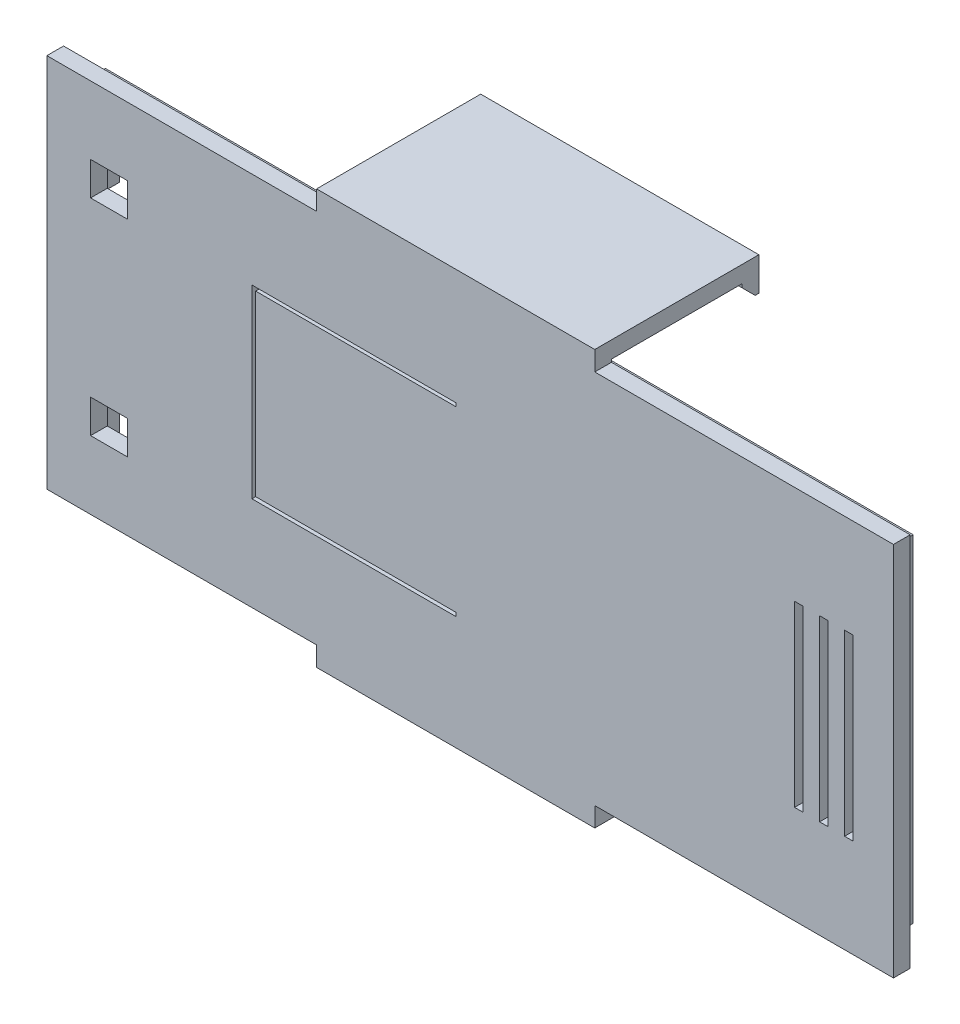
ISO-10303-21;
HEADER;
FILE_DESCRIPTION(('STEP AP214'),'2;1');
FILE_NAME('part.step','',(''),(''),'','','');
FILE_SCHEMA(('AUTOMOTIVE_DESIGN { 1 0 10303 214 1 1 1 1 }'));
ENDSEC;
DATA;
#1=APPLICATION_CONTEXT('core data for automotive mechanical design processes');
#2=APPLICATION_PROTOCOL_DEFINITION('international standard','automotive_design',2000,#1);
#3=PRODUCT_CONTEXT('',#1,'mechanical');
#4=PRODUCT('Part','Part','',(#3));
#5=PRODUCT_RELATED_PRODUCT_CATEGORY('part','',(#4));
#6=PRODUCT_DEFINITION_FORMATION('','',#4);
#7=PRODUCT_DEFINITION_CONTEXT('part definition',#1,'design');
#8=PRODUCT_DEFINITION('design','',#6,#7);
#9=PRODUCT_DEFINITION_SHAPE('','',#8);
#10=(LENGTH_UNIT() NAMED_UNIT(*) SI_UNIT(.MILLI.,.METRE.));
#11=(NAMED_UNIT(*) PLANE_ANGLE_UNIT() SI_UNIT($,.RADIAN.));
#12=(NAMED_UNIT(*) SI_UNIT($,.STERADIAN.) SOLID_ANGLE_UNIT());
#13=UNCERTAINTY_MEASURE_WITH_UNIT(LENGTH_MEASURE(1.E-05),#10,'distance_accuracy_value','');
#14=(GEOMETRIC_REPRESENTATION_CONTEXT(3) GLOBAL_UNCERTAINTY_ASSIGNED_CONTEXT((#13)) GLOBAL_UNIT_ASSIGNED_CONTEXT((#10,
#11,#12)) REPRESENTATION_CONTEXT('',''));
#15=CARTESIAN_POINT('',(0.,0.,0.));
#16=DIRECTION('',(0.,0.,1.));
#17=DIRECTION('',(1.,0.,0.));
#18=AXIS2_PLACEMENT_3D('',#15,#16,#17);
#19=CARTESIAN_POINT('',(0.767556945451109,0.0425321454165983,6.9));
#20=DIRECTION('',(0.,0.,1.));
#21=DIRECTION('',(1.,0.,0.));
#22=AXIS2_PLACEMENT_3D('',#19,#20,#21);
#23=PLANE('',#22);
#24=DIRECTION('',(1.,0.,0.));
#25=VECTOR('',#24,1.);
#26=CARTESIAN_POINT('',(-19.7000004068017,-4.59999988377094,6.9));
#27=LINE('',#26,#25);
#28=CARTESIAN_POINT('',(-19.7000004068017,-4.59999988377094,6.9));
#29=VERTEX_POINT('',#28);
#30=CARTESIAN_POINT('',(-17.7000004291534,-4.59999988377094,6.9));
#31=VERTEX_POINT('',#30);
#32=EDGE_CURVE('E673',#29,#31,#27,.T.);
#33=ORIENTED_EDGE('',*,*,#32,.T.);
#34=DIRECTION('',(0.,-1.,0.));
#35=VECTOR('',#34,1.);
#36=CARTESIAN_POINT('',(-17.7000004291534,-4.59999988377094,6.9));
#37=LINE('',#36,#35);
#38=CARTESIAN_POINT('',(-17.7000004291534,-6.39999986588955,6.9));
#39=VERTEX_POINT('',#38);
#40=EDGE_CURVE('E1029',#31,#39,#37,.T.);
#41=ORIENTED_EDGE('',*,*,#40,.T.);
#42=DIRECTION('',(-1.,0.,0.));
#43=VECTOR('',#42,1.);
#44=CARTESIAN_POINT('',(-17.7000004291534,-6.39999986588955,6.9));
#45=LINE('',#44,#43);
#46=CARTESIAN_POINT('',(-19.7000004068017,-6.39999986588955,6.9));
#47=VERTEX_POINT('',#46);
#48=EDGE_CURVE('E654',#39,#47,#45,.T.);
#49=ORIENTED_EDGE('',*,*,#48,.T.);
#50=DIRECTION('',(0.,1.,0.));
#51=VECTOR('',#50,1.);
#52=CARTESIAN_POINT('',(-19.7000004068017,-6.39999986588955,6.9));
#53=LINE('',#52,#51);
#54=EDGE_CURVE('E668',#47,#29,#53,.T.);
#55=ORIENTED_EDGE('',*,*,#54,.T.);
#56=EDGE_LOOP('',(#33,#41,#49,#55));
#57=FACE_BOUND('',#56,.T.);
#58=DIRECTION('',(1.,0.,0.));
#59=VECTOR('',#58,1.);
#60=CARTESIAN_POINT('',(-19.7000004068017,6.49999986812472,6.9));
#61=LINE('',#60,#59);
#62=CARTESIAN_POINT('',(-19.7000004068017,6.49999986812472,6.9));
#63=VERTEX_POINT('',#62);
#64=CARTESIAN_POINT('',(-17.7000004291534,6.49999986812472,6.9));
#65=VERTEX_POINT('',#64);
#66=EDGE_CURVE('E42',#63,#65,#61,.T.);
#67=ORIENTED_EDGE('',*,*,#66,.T.);
#68=DIRECTION('',(0.,-1.,0.));
#69=VECTOR('',#68,1.);
#70=CARTESIAN_POINT('',(-17.7000004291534,6.49999986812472,6.9));
#71=LINE('',#70,#69);
#72=CARTESIAN_POINT('',(-17.7000004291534,4.69999988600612,6.9));
#73=VERTEX_POINT('',#72);
#74=EDGE_CURVE('E853',#65,#73,#71,.T.);
#75=ORIENTED_EDGE('',*,*,#74,.T.);
#76=DIRECTION('',(-1.,0.,0.));
#77=VECTOR('',#76,1.);
#78=CARTESIAN_POINT('',(-17.7000004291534,4.69999988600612,6.9));
#79=LINE('',#78,#77);
#80=CARTESIAN_POINT('',(-19.7000004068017,4.69999988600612,6.9));
#81=VERTEX_POINT('',#80);
#82=EDGE_CURVE('E551',#73,#81,#79,.T.);
#83=ORIENTED_EDGE('',*,*,#82,.T.);
#84=DIRECTION('',(0.,1.,0.));
#85=VECTOR('',#84,1.);
#86=CARTESIAN_POINT('',(-19.7000004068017,4.69999988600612,6.9));
#87=LINE('',#86,#85);
#88=EDGE_CURVE('E1014',#81,#63,#87,.T.);
#89=ORIENTED_EDGE('',*,*,#88,.T.);
#90=EDGE_LOOP('',(#67,#75,#83,#89));
#91=FACE_BOUND('',#90,.T.);
#92=DIRECTION('',(0.,-1.,0.));
#93=VECTOR('',#92,1.);
#94=CARTESIAN_POINT('',(21.4088612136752,-2.36829532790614,6.9));
#95=LINE('',#94,#93);
#96=CARTESIAN_POINT('',(21.4088612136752,4.845399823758,6.9));
#97=VERTEX_POINT('',#96);
#98=CARTESIAN_POINT('',(21.4088612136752,-4.77912280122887,6.9));
#99=VERTEX_POINT('',#98);
#100=EDGE_CURVE('E545',#97,#99,#95,.T.);
#101=ORIENTED_EDGE('',*,*,#100,.T.);
#102=DIRECTION('',(-1.,0.,0.));
#103=VECTOR('',#102,1.);
#104=CARTESIAN_POINT('',(10.8632090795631,-4.77912280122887,6.9));
#105=LINE('',#104,#103);
#106=CARTESIAN_POINT('',(20.9588612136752,-4.77912280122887,6.9));
#107=VERTEX_POINT('',#106);
#108=EDGE_CURVE('E761',#99,#107,#105,.T.);
#109=ORIENTED_EDGE('',*,*,#108,.T.);
#110=DIRECTION('',(0.,1.,0.));
#111=VECTOR('',#110,1.);
#112=CARTESIAN_POINT('',(20.9588612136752,2.4439659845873,6.9));
#113=LINE('',#112,#111);
#114=CARTESIAN_POINT('',(20.9588612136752,4.845399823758,6.9));
#115=VERTEX_POINT('',#114);
#116=EDGE_CURVE('E924',#107,#115,#113,.T.);
#117=ORIENTED_EDGE('',*,*,#116,.T.);
#118=DIRECTION('',(1.,0.,0.));
#119=VECTOR('',#118,1.);
#120=CARTESIAN_POINT('',(11.0882090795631,4.845399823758,6.9));
#121=LINE('',#120,#119);
#122=EDGE_CURVE('E999',#115,#97,#121,.T.);
#123=ORIENTED_EDGE('',*,*,#122,.T.);
#124=EDGE_LOOP('',(#101,#109,#117,#123));
#125=FACE_BOUND('',#124,.T.);
#126=DIRECTION('',(0.,1.,0.));
#127=VECTOR('',#126,1.);
#128=CARTESIAN_POINT('',(19.6088612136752,2.4439659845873,6.9));
#129=LINE('',#128,#127);
#130=CARTESIAN_POINT('',(19.6088612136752,-4.77912280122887,6.9));
#131=VERTEX_POINT('',#130);
#132=CARTESIAN_POINT('',(19.6088612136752,4.845399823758,6.9));
#133=VERTEX_POINT('',#132);
#134=EDGE_CURVE('E845',#131,#133,#129,.T.);
#135=ORIENTED_EDGE('',*,*,#134,.T.);
#136=DIRECTION('',(1.,0.,0.));
#137=VECTOR('',#136,1.);
#138=CARTESIAN_POINT('',(10.4132090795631,4.845399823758,6.9));
#139=LINE('',#138,#137);
#140=CARTESIAN_POINT('',(20.0588612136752,4.845399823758,6.9));
#141=VERTEX_POINT('',#140);
#142=EDGE_CURVE('E877',#133,#141,#139,.T.);
#143=ORIENTED_EDGE('',*,*,#142,.T.);
#144=DIRECTION('',(0.,-1.,0.));
#145=VECTOR('',#144,1.);
#146=CARTESIAN_POINT('',(20.0588612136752,-2.36829532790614,6.9));
#147=LINE('',#146,#145);
#148=CARTESIAN_POINT('',(20.0588612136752,-4.77912280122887,6.9));
#149=VERTEX_POINT('',#148);
#150=EDGE_CURVE('E901',#141,#149,#147,.T.);
#151=ORIENTED_EDGE('',*,*,#150,.T.);
#152=DIRECTION('',(-1.,0.,0.));
#153=VECTOR('',#152,1.);
#154=CARTESIAN_POINT('',(10.1882090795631,-4.77912280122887,6.9));
#155=LINE('',#154,#153);
#156=EDGE_CURVE('E550',#149,#131,#155,.T.);
#157=ORIENTED_EDGE('',*,*,#156,.T.);
#158=EDGE_LOOP('',(#135,#143,#151,#157));
#159=FACE_BOUND('',#158,.T.);
#160=DIRECTION('',(0.,-1.,0.));
#161=VECTOR('',#160,1.);
#162=CARTESIAN_POINT('',(18.7088612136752,-2.36829532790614,6.9));
#163=LINE('',#162,#161);
#164=CARTESIAN_POINT('',(18.7088612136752,4.845399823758,6.9));
#165=VERTEX_POINT('',#164);
#166=CARTESIAN_POINT('',(18.7088612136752,-4.77912280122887,6.9));
#167=VERTEX_POINT('',#166);
#168=EDGE_CURVE('E963',#165,#167,#163,.T.);
#169=ORIENTED_EDGE('',*,*,#168,.T.);
#170=DIRECTION('',(-1.,0.,0.));
#171=VECTOR('',#170,1.);
#172=CARTESIAN_POINT('',(9.51320907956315,-4.77912280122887,6.9));
#173=LINE('',#172,#171);
#174=CARTESIAN_POINT('',(18.2588612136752,-4.77912280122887,6.9));
#175=VERTEX_POINT('',#174);
#176=EDGE_CURVE('E544',#167,#175,#173,.T.);
#177=ORIENTED_EDGE('',*,*,#176,.T.);
#178=DIRECTION('',(0.,1.,0.));
#179=VECTOR('',#178,1.);
#180=CARTESIAN_POINT('',(18.2588612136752,2.4439659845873,6.9));
#181=LINE('',#180,#179);
#182=CARTESIAN_POINT('',(18.2588612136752,4.845399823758,6.9));
#183=VERTEX_POINT('',#182);
#184=EDGE_CURVE('E543',#175,#183,#181,.T.);
#185=ORIENTED_EDGE('',*,*,#184,.T.);
#186=DIRECTION('',(1.,0.,0.));
#187=VECTOR('',#186,1.);
#188=CARTESIAN_POINT('',(9.73820907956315,4.845399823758,6.9));
#189=LINE('',#188,#187);
#190=EDGE_CURVE('E850',#183,#165,#189,.T.);
#191=ORIENTED_EDGE('',*,*,#190,.T.);
#192=EDGE_LOOP('',(#169,#177,#185,#191));
#193=FACE_BOUND('',#192,.T.);
#194=DIRECTION('',(1.,0.,0.));
#195=VECTOR('',#194,1.);
#196=CARTESIAN_POINT('',(0.383778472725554,4.98506765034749,6.9));
#197=LINE('',#196,#195);
#198=CARTESIAN_POINT('',(-10.9999998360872,4.98506765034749,6.9));
#199=VERTEX_POINT('',#198);
#200=CARTESIAN_POINT('',(0.,4.98506765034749,6.9));
#201=VERTEX_POINT('',#200);
#202=EDGE_CURVE('E1086',#199,#201,#197,.T.);
#203=ORIENTED_EDGE('',*,*,#202,.T.);
#204=DIRECTION('',(0.,-1.,0.));
#205=VECTOR('',#204,1.);
#206=CARTESIAN_POINT('',(0.,2.42126601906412,6.9));
#207=LINE('',#206,#205);
#208=CARTESIAN_POINT('',(0.,4.79999989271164,6.9));
#209=VERTEX_POINT('',#208);
#210=EDGE_CURVE('E824',#201,#209,#207,.T.);
#211=ORIENTED_EDGE('',*,*,#210,.T.);
#212=DIRECTION('',(-1.,0.,0.));
#213=VECTOR('',#212,1.);
#214=CARTESIAN_POINT('',(-5.01622152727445,4.79999989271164,6.9));
#215=LINE('',#214,#213);
#216=CARTESIAN_POINT('',(-10.8,4.79999989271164,6.9));
#217=VERTEX_POINT('',#216);
#218=EDGE_CURVE('E511',#209,#217,#215,.T.);
#219=ORIENTED_EDGE('',*,*,#218,.T.);
#220=DIRECTION('',(0.,-1.,0.));
#221=VECTOR('',#220,1.);
#222=CARTESIAN_POINT('',(-10.8,-2.37873398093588,6.9));
#223=LINE('',#222,#221);
#224=CARTESIAN_POINT('',(-10.8,-4.80000010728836,6.9));
#225=VERTEX_POINT('',#224);
#226=EDGE_CURVE('E806',#217,#225,#223,.T.);
#227=ORIENTED_EDGE('',*,*,#226,.T.);
#228=DIRECTION('',(1.,0.,0.));
#229=VECTOR('',#228,1.);
#230=CARTESIAN_POINT('',(0.383778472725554,-4.80000010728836,6.9));
#231=LINE('',#230,#229);
#232=CARTESIAN_POINT('',(0.,-4.80000010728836,6.9));
#233=VERTEX_POINT('',#232);
#234=EDGE_CURVE('E865',#225,#233,#231,.T.);
#235=ORIENTED_EDGE('',*,*,#234,.T.);
#236=DIRECTION('',(0.,-1.,0.));
#237=VECTOR('',#236,1.);
#238=CARTESIAN_POINT('',(0.,-2.4787339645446,6.9));
#239=LINE('',#238,#237);
#240=CARTESIAN_POINT('',(0.,-5.00000007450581,6.9));
#241=VERTEX_POINT('',#240);
#242=EDGE_CURVE('E844',#233,#241,#239,.T.);
#243=ORIENTED_EDGE('',*,*,#242,.T.);
#244=DIRECTION('',(-1.,0.,0.));
#245=VECTOR('',#244,1.);
#246=CARTESIAN_POINT('',(-5.11622144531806,-5.00000007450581,6.9));
#247=LINE('',#246,#245);
#248=CARTESIAN_POINT('',(-10.9999998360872,-5.00000007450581,6.9));
#249=VERTEX_POINT('',#248);
#250=EDGE_CURVE('E1143',#241,#249,#247,.T.);
#251=ORIENTED_EDGE('',*,*,#250,.T.);
#252=DIRECTION('',(0.,1.,0.));
#253=VECTOR('',#252,1.);
#254=CARTESIAN_POINT('',(-10.9999998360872,2.51379989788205,6.9));
#255=LINE('',#254,#253);
#256=EDGE_CURVE('E660',#249,#199,#255,.T.);
#257=ORIENTED_EDGE('',*,*,#256,.T.);
#258=EDGE_LOOP('',(#203,#211,#219,#227,#235,#243,#251,#257));
#259=FACE_BOUND('',#258,.T.);
#260=DIRECTION('',(1.,0.,0.));
#261=VECTOR('',#260,1.);
#262=CARTESIAN_POINT('',(23.5925569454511,-10.0809678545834,6.9));
#263=LINE('',#262,#261);
#264=CARTESIAN_POINT('',(-22.0574430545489,-10.0809678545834,6.9));
#265=VERTEX_POINT('',#264);
#266=CARTESIAN_POINT('',(-7.51378692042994,-10.0809678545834,6.9));
#267=VERTEX_POINT('',#266);
#268=EDGE_CURVE('E1115',#265,#267,#263,.T.);
#269=ORIENTED_EDGE('',*,*,#268,.T.);
#270=DIRECTION('',(0.,-1.,0.));
#271=VECTOR('',#270,1.);
#272=CARTESIAN_POINT('',(-7.51378692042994,-11.1309678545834,6.9));
#273=LINE('',#272,#271);
#274=CARTESIAN_POINT('',(-7.51378692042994,-11.1309678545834,6.9));
#275=VERTEX_POINT('',#274);
#276=EDGE_CURVE('E634',#267,#275,#273,.T.);
#277=ORIENTED_EDGE('',*,*,#276,.T.);
#278=DIRECTION('',(1.,0.,0.));
#279=VECTOR('',#278,1.);
#280=CARTESIAN_POINT('',(7.48621307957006,-11.1309678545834,6.9));
#281=LINE('',#280,#279);
#282=CARTESIAN_POINT('',(7.48621307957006,-11.1309678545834,6.9));
#283=VERTEX_POINT('',#282);
#284=EDGE_CURVE('E684',#275,#283,#281,.T.);
#285=ORIENTED_EDGE('',*,*,#284,.T.);
#286=DIRECTION('',(0.,1.,0.));
#287=VECTOR('',#286,1.);
#288=CARTESIAN_POINT('',(7.48621307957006,-10.0809678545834,6.9));
#289=LINE('',#288,#287);
#290=CARTESIAN_POINT('',(7.48621307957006,-10.0809678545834,6.9));
#291=VERTEX_POINT('',#290);
#292=EDGE_CURVE('E685',#283,#291,#289,.T.);
#293=ORIENTED_EDGE('',*,*,#292,.T.);
#294=DIRECTION('',(1.,0.,0.));
#295=VECTOR('',#294,1.);
#296=CARTESIAN_POINT('',(23.5925569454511,-10.0809678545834,6.9));
#297=LINE('',#296,#295);
#298=CARTESIAN_POINT('',(23.5925569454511,-10.0809678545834,6.9));
#299=VERTEX_POINT('',#298);
#300=EDGE_CURVE('E860',#291,#299,#297,.T.);
#301=ORIENTED_EDGE('',*,*,#300,.T.);
#302=DIRECTION('',(0.,1.,0.));
#303=VECTOR('',#302,1.);
#304=CARTESIAN_POINT('',(23.5925569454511,10.1660321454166,6.9));
#305=LINE('',#304,#303);
#306=CARTESIAN_POINT('',(23.5925569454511,10.1660321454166,6.9));
#307=VERTEX_POINT('',#306);
#308=EDGE_CURVE('E11',#299,#307,#305,.T.);
#309=ORIENTED_EDGE('',*,*,#308,.T.);
#310=DIRECTION('',(-1.,0.,0.));
#311=VECTOR('',#310,1.);
#312=CARTESIAN_POINT('',(-22.0574430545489,10.1660321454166,6.9));
#313=LINE('',#312,#311);
#314=CARTESIAN_POINT('',(7.48621307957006,10.1660321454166,6.9));
#315=VERTEX_POINT('',#314);
#316=EDGE_CURVE('E951',#307,#315,#313,.T.);
#317=ORIENTED_EDGE('',*,*,#316,.T.);
#318=DIRECTION('',(0.,1.,0.));
#319=VECTOR('',#318,1.);
#320=CARTESIAN_POINT('',(7.48621307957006,10.1660321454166,6.9));
#321=LINE('',#320,#319);
#322=CARTESIAN_POINT('',(7.48621307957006,11.2160321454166,6.9));
#323=VERTEX_POINT('',#322);
#324=EDGE_CURVE('E726',#315,#323,#321,.T.);
#325=ORIENTED_EDGE('',*,*,#324,.T.);
#326=DIRECTION('',(-1.,0.,0.));
#327=VECTOR('',#326,1.);
#328=CARTESIAN_POINT('',(7.48621307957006,11.2160321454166,6.9));
#329=LINE('',#328,#327);
#330=CARTESIAN_POINT('',(-7.51378692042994,11.2160321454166,6.9));
#331=VERTEX_POINT('',#330);
#332=EDGE_CURVE('E517',#323,#331,#329,.T.);
#333=ORIENTED_EDGE('',*,*,#332,.T.);
#334=DIRECTION('',(0.,-1.,0.));
#335=VECTOR('',#334,1.);
#336=CARTESIAN_POINT('',(-7.51378692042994,11.2160321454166,6.9));
#337=LINE('',#336,#335);
#338=CARTESIAN_POINT('',(-7.51378692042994,10.1660321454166,6.9));
#339=VERTEX_POINT('',#338);
#340=EDGE_CURVE('E518',#331,#339,#337,.T.);
#341=ORIENTED_EDGE('',*,*,#340,.T.);
#342=DIRECTION('',(-1.,0.,0.));
#343=VECTOR('',#342,1.);
#344=CARTESIAN_POINT('',(-22.0574430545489,10.1660321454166,6.9));
#345=LINE('',#344,#343);
#346=CARTESIAN_POINT('',(-22.0574430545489,10.1660321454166,6.9));
#347=VERTEX_POINT('',#346);
#348=EDGE_CURVE('E1010',#339,#347,#345,.T.);
#349=ORIENTED_EDGE('',*,*,#348,.T.);
#350=DIRECTION('',(0.,-1.,0.));
#351=VECTOR('',#350,1.);
#352=CARTESIAN_POINT('',(-22.0574430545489,-10.0809678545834,6.9));
#353=LINE('',#352,#351);
#354=EDGE_CURVE('E28',#347,#265,#353,.T.);
#355=ORIENTED_EDGE('',*,*,#354,.T.);
#356=EDGE_LOOP('',(#269,#277,#285,#293,#301,#309,#317,#325,#333,#341,#349,#355));
#357=FACE_BOUND('',#356,.T.);
#358=ADVANCED_FACE('F17',(#57,#91,#125,#159,#193,#259,#357),#23,.T.);
#359=CARTESIAN_POINT('',(23.5925569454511,-10.0809678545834,6.));
#360=DIRECTION('',(1.,0.,0.));
#361=DIRECTION('',(0.,1.,0.));
#362=AXIS2_PLACEMENT_3D('',#359,#360,#361);
#363=PLANE('',#362);
#364=DIRECTION('',(0.,-1.,0.));
#365=VECTOR('',#364,1.);
#366=CARTESIAN_POINT('',(23.5925569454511,10.1660321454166,6.));
#367=LINE('',#366,#365);
#368=CARTESIAN_POINT('',(23.5925569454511,10.1660321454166,6.));
#369=VERTEX_POINT('',#368);
#370=CARTESIAN_POINT('',(23.5925569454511,-10.0809678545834,6.));
#371=VERTEX_POINT('',#370);
#372=EDGE_CURVE('E690',#369,#371,#367,.T.);
#373=ORIENTED_EDGE('',*,*,#372,.F.);
#374=DIRECTION('',(0.,0.,1.));
#375=VECTOR('',#374,1.);
#376=CARTESIAN_POINT('',(23.5925569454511,10.1660321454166,6.));
#377=LINE('',#376,#375);
#378=EDGE_CURVE('E946',#369,#307,#377,.T.);
#379=ORIENTED_EDGE('',*,*,#378,.T.);
#380=ORIENTED_EDGE('',*,*,#308,.F.);
#381=DIRECTION('',(0.,0.,1.));
#382=VECTOR('',#381,1.);
#383=CARTESIAN_POINT('',(23.5925569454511,-10.0809678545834,6.));
#384=LINE('',#383,#382);
#385=EDGE_CURVE('E856',#371,#299,#384,.T.);
#386=ORIENTED_EDGE('',*,*,#385,.F.);
#387=EDGE_LOOP('',(#373,#379,#380,#386));
#388=FACE_BOUND('',#387,.T.);
#389=ADVANCED_FACE('F1612',(#388),#363,.T.);
#390=CARTESIAN_POINT('',(-22.0574430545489,10.1660321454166,6.));
#391=DIRECTION('',(-1.,0.,0.));
#392=DIRECTION('',(0.,0.,1.));
#393=AXIS2_PLACEMENT_3D('',#390,#391,#392);
#394=PLANE('',#393);
#395=DIRECTION('',(0.,1.,0.));
#396=VECTOR('',#395,1.);
#397=CARTESIAN_POINT('',(-22.0574430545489,-10.0809678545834,6.));
#398=LINE('',#397,#396);
#399=CARTESIAN_POINT('',(-22.0574430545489,-10.0809678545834,6.));
#400=VERTEX_POINT('',#399);
#401=CARTESIAN_POINT('',(-22.0574430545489,10.1660321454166,6.));
#402=VERTEX_POINT('',#401);
#403=EDGE_CURVE('E693',#400,#402,#398,.T.);
#404=ORIENTED_EDGE('',*,*,#403,.F.);
#405=DIRECTION('',(0.,0.,1.));
#406=VECTOR('',#405,1.);
#407=CARTESIAN_POINT('',(-22.0574430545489,-10.0809678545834,6.));
#408=LINE('',#407,#406);
#409=EDGE_CURVE('E1087',#400,#265,#408,.T.);
#410=ORIENTED_EDGE('',*,*,#409,.T.);
#411=ORIENTED_EDGE('',*,*,#354,.F.);
#412=DIRECTION('',(0.,0.,1.));
#413=VECTOR('',#412,1.);
#414=CARTESIAN_POINT('',(-22.0574430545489,10.1660321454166,6.));
#415=LINE('',#414,#413);
#416=EDGE_CURVE('E979',#402,#347,#415,.T.);
#417=ORIENTED_EDGE('',*,*,#416,.F.);
#418=EDGE_LOOP('',(#404,#410,#411,#417));
#419=FACE_BOUND('',#418,.T.);
#420=ADVANCED_FACE('F1607',(#419),#394,.T.);
#421=CARTESIAN_POINT('',(-19.7000004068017,6.49999986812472,6.));
#422=DIRECTION('',(0.,-1.,0.));
#423=DIRECTION('',(0.,0.,-1.));
#424=AXIS2_PLACEMENT_3D('',#421,#422,#423);
#425=PLANE('',#424);
#426=DIRECTION('',(1.,0.,0.));
#427=VECTOR('',#426,1.);
#428=CARTESIAN_POINT('',(-19.7000004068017,6.49999986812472,6.));
#429=LINE('',#428,#427);
#430=CARTESIAN_POINT('',(-19.7000004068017,6.49999986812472,6.));
#431=VERTEX_POINT('',#430);
#432=CARTESIAN_POINT('',(-17.7000004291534,6.49999986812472,6.));
#433=VERTEX_POINT('',#432);
#434=EDGE_CURVE('E743',#431,#433,#429,.T.);
#435=ORIENTED_EDGE('',*,*,#434,.T.);
#436=DIRECTION('',(0.,0.,1.));
#437=VECTOR('',#436,1.);
#438=CARTESIAN_POINT('',(-17.7000004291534,6.49999986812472,6.));
#439=LINE('',#438,#437);
#440=EDGE_CURVE('E538',#433,#65,#439,.T.);
#441=ORIENTED_EDGE('',*,*,#440,.T.);
#442=ORIENTED_EDGE('',*,*,#66,.F.);
#443=DIRECTION('',(0.,0.,1.));
#444=VECTOR('',#443,1.);
#445=CARTESIAN_POINT('',(-19.7000004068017,6.49999986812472,6.));
#446=LINE('',#445,#444);
#447=EDGE_CURVE('E676',#431,#63,#446,.T.);
#448=ORIENTED_EDGE('',*,*,#447,.F.);
#449=EDGE_LOOP('',(#435,#441,#442,#448));
#450=FACE_BOUND('',#449,.T.);
#451=ADVANCED_FACE('F1246',(#450),#425,.T.);
#452=CARTESIAN_POINT('',(-17.7000004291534,6.49999986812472,6.));
#453=DIRECTION('',(-1.,0.,0.));
#454=DIRECTION('',(0.,0.,1.));
#455=AXIS2_PLACEMENT_3D('',#452,#453,#454);
#456=PLANE('',#455);
#457=DIRECTION('',(0.,-1.,0.));
#458=VECTOR('',#457,1.);
#459=CARTESIAN_POINT('',(-17.7000004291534,6.49999986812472,6.));
#460=LINE('',#459,#458);
#461=CARTESIAN_POINT('',(-17.7000004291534,4.69999988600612,6.));
#462=VERTEX_POINT('',#461);
#463=EDGE_CURVE('E1018',#433,#462,#460,.T.);
#464=ORIENTED_EDGE('',*,*,#463,.T.);
#465=DIRECTION('',(0.,0.,1.));
#466=VECTOR('',#465,1.);
#467=CARTESIAN_POINT('',(-17.7000004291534,4.69999988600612,6.));
#468=LINE('',#467,#466);
#469=EDGE_CURVE('E555',#462,#73,#468,.T.);
#470=ORIENTED_EDGE('',*,*,#469,.T.);
#471=ORIENTED_EDGE('',*,*,#74,.F.);
#472=ORIENTED_EDGE('',*,*,#440,.F.);
#473=EDGE_LOOP('',(#464,#470,#471,#472));
#474=FACE_BOUND('',#473,.T.);
#475=ADVANCED_FACE('F1252',(#474),#456,.T.);
#476=CARTESIAN_POINT('',(-17.7000004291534,4.69999988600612,6.));
#477=DIRECTION('',(0.,1.,0.));
#478=DIRECTION('',(1.,0.,0.));
#479=AXIS2_PLACEMENT_3D('',#476,#477,#478);
#480=PLANE('',#479);
#481=DIRECTION('',(-1.,0.,0.));
#482=VECTOR('',#481,1.);
#483=CARTESIAN_POINT('',(-17.7000004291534,4.69999988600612,6.));
#484=LINE('',#483,#482);
#485=CARTESIAN_POINT('',(-19.7000004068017,4.69999988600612,6.));
#486=VERTEX_POINT('',#485);
#487=EDGE_CURVE('E832',#462,#486,#484,.T.);
#488=ORIENTED_EDGE('',*,*,#487,.T.);
#489=DIRECTION('',(0.,0.,1.));
#490=VECTOR('',#489,1.);
#491=CARTESIAN_POINT('',(-19.7000004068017,4.69999988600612,6.));
#492=LINE('',#491,#490);
#493=EDGE_CURVE('E556',#486,#81,#492,.T.);
#494=ORIENTED_EDGE('',*,*,#493,.T.);
#495=ORIENTED_EDGE('',*,*,#82,.F.);
#496=ORIENTED_EDGE('',*,*,#469,.F.);
#497=EDGE_LOOP('',(#488,#494,#495,#496));
#498=FACE_BOUND('',#497,.T.);
#499=ADVANCED_FACE('F1256',(#498),#480,.T.);
#500=CARTESIAN_POINT('',(-19.7000004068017,4.69999988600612,6.));
#501=DIRECTION('',(1.,0.,0.));
#502=DIRECTION('',(0.,1.,0.));
#503=AXIS2_PLACEMENT_3D('',#500,#501,#502);
#504=PLANE('',#503);
#505=DIRECTION('',(0.,1.,0.));
#506=VECTOR('',#505,1.);
#507=CARTESIAN_POINT('',(-19.7000004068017,4.69999988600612,6.));
#508=LINE('',#507,#506);
#509=EDGE_CURVE('E747',#486,#431,#508,.T.);
#510=ORIENTED_EDGE('',*,*,#509,.T.);
#511=ORIENTED_EDGE('',*,*,#447,.T.);
#512=ORIENTED_EDGE('',*,*,#88,.F.);
#513=ORIENTED_EDGE('',*,*,#493,.F.);
#514=EDGE_LOOP('',(#510,#511,#512,#513));
#515=FACE_BOUND('',#514,.T.);
#516=ADVANCED_FACE('F1242',(#515),#504,.T.);
#517=CARTESIAN_POINT('',(-19.7000004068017,-4.59999988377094,6.));
#518=DIRECTION('',(0.,-1.,0.));
#519=DIRECTION('',(0.,0.,-1.));
#520=AXIS2_PLACEMENT_3D('',#517,#518,#519);
#521=PLANE('',#520);
#522=DIRECTION('',(1.,0.,0.));
#523=VECTOR('',#522,1.);
#524=CARTESIAN_POINT('',(-19.7000004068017,-4.59999988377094,6.));
#525=LINE('',#524,#523);
#526=CARTESIAN_POINT('',(-19.7000004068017,-4.59999988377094,6.));
#527=VERTEX_POINT('',#526);
#528=CARTESIAN_POINT('',(-17.7000004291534,-4.59999988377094,6.));
#529=VERTEX_POINT('',#528);
#530=EDGE_CURVE('E627',#527,#529,#525,.T.);
#531=ORIENTED_EDGE('',*,*,#530,.T.);
#532=DIRECTION('',(0.,0.,1.));
#533=VECTOR('',#532,1.);
#534=CARTESIAN_POINT('',(-17.7000004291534,-4.59999988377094,6.));
#535=LINE('',#534,#533);
#536=EDGE_CURVE('E677',#529,#31,#535,.T.);
#537=ORIENTED_EDGE('',*,*,#536,.T.);
#538=ORIENTED_EDGE('',*,*,#32,.F.);
#539=DIRECTION('',(0.,0.,1.));
#540=VECTOR('',#539,1.);
#541=CARTESIAN_POINT('',(-19.7000004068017,-4.59999988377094,6.));
#542=LINE('',#541,#540);
#543=EDGE_CURVE('E575',#527,#29,#542,.T.);
#544=ORIENTED_EDGE('',*,*,#543,.F.);
#545=EDGE_LOOP('',(#531,#537,#538,#544));
#546=FACE_BOUND('',#545,.T.);
#547=ADVANCED_FACE('F1689',(#546),#521,.T.);
#548=CARTESIAN_POINT('',(-17.7000004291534,-4.59999988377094,6.));
#549=DIRECTION('',(-1.,0.,0.));
#550=DIRECTION('',(0.,0.,1.));
#551=AXIS2_PLACEMENT_3D('',#548,#549,#550);
#552=PLANE('',#551);
#553=DIRECTION('',(0.,-1.,0.));
#554=VECTOR('',#553,1.);
#555=CARTESIAN_POINT('',(-17.7000004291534,-4.59999988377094,6.));
#556=LINE('',#555,#554);
#557=CARTESIAN_POINT('',(-17.7000004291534,-6.39999986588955,6.));
#558=VERTEX_POINT('',#557);
#559=EDGE_CURVE('E748',#529,#558,#556,.T.);
#560=ORIENTED_EDGE('',*,*,#559,.T.);
#561=DIRECTION('',(0.,0.,1.));
#562=VECTOR('',#561,1.);
#563=CARTESIAN_POINT('',(-17.7000004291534,-6.39999986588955,6.));
#564=LINE('',#563,#562);
#565=EDGE_CURVE('E1032',#558,#39,#564,.T.);
#566=ORIENTED_EDGE('',*,*,#565,.T.);
#567=ORIENTED_EDGE('',*,*,#40,.F.);
#568=ORIENTED_EDGE('',*,*,#536,.F.);
#569=EDGE_LOOP('',(#560,#566,#567,#568));
#570=FACE_BOUND('',#569,.T.);
#571=ADVANCED_FACE('F1694',(#570),#552,.T.);
#572=CARTESIAN_POINT('',(-17.7000004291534,-6.39999986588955,6.));
#573=DIRECTION('',(0.,1.,0.));
#574=DIRECTION('',(1.,0.,0.));
#575=AXIS2_PLACEMENT_3D('',#572,#573,#574);
#576=PLANE('',#575);
#577=DIRECTION('',(-1.,0.,0.));
#578=VECTOR('',#577,1.);
#579=CARTESIAN_POINT('',(-17.7000004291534,-6.39999986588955,6.));
#580=LINE('',#579,#578);
#581=CARTESIAN_POINT('',(-19.7000004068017,-6.39999986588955,6.));
#582=VERTEX_POINT('',#581);
#583=EDGE_CURVE('E626',#558,#582,#580,.T.);
#584=ORIENTED_EDGE('',*,*,#583,.T.);
#585=DIRECTION('',(0.,0.,1.));
#586=VECTOR('',#585,1.);
#587=CARTESIAN_POINT('',(-19.7000004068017,-6.39999986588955,6.));
#588=LINE('',#587,#586);
#589=EDGE_CURVE('E672',#582,#47,#588,.T.);
#590=ORIENTED_EDGE('',*,*,#589,.T.);
#591=ORIENTED_EDGE('',*,*,#48,.F.);
#592=ORIENTED_EDGE('',*,*,#565,.F.);
#593=EDGE_LOOP('',(#584,#590,#591,#592));
#594=FACE_BOUND('',#593,.T.);
#595=ADVANCED_FACE('F1963',(#594),#576,.T.);
#596=CARTESIAN_POINT('',(-19.7000004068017,-6.39999986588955,6.));
#597=DIRECTION('',(1.,0.,0.));
#598=DIRECTION('',(0.,1.,0.));
#599=AXIS2_PLACEMENT_3D('',#596,#597,#598);
#600=PLANE('',#599);
#601=DIRECTION('',(0.,1.,0.));
#602=VECTOR('',#601,1.);
#603=CARTESIAN_POINT('',(-19.7000004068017,-6.39999986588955,6.));
#604=LINE('',#603,#602);
#605=EDGE_CURVE('E622',#582,#527,#604,.T.);
#606=ORIENTED_EDGE('',*,*,#605,.T.);
#607=ORIENTED_EDGE('',*,*,#543,.T.);
#608=ORIENTED_EDGE('',*,*,#54,.F.);
#609=ORIENTED_EDGE('',*,*,#589,.F.);
#610=EDGE_LOOP('',(#606,#607,#608,#609));
#611=FACE_BOUND('',#610,.T.);
#612=ADVANCED_FACE('F1707',(#611),#600,.T.);
#613=CARTESIAN_POINT('',(-9.59999974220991,-0.0500000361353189,5.8));
#614=DIRECTION('',(0.,0.,-1.));
#615=DIRECTION('',(0.,-1.,0.));
#616=AXIS2_PLACEMENT_3D('',#613,#614,#615);
#617=PLANE('',#616);
#618=DIRECTION('',(0.,-1.,0.));
#619=VECTOR('',#618,1.);
#620=CARTESIAN_POINT('',(-8.39999948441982,-2.00000002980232,5.8));
#621=LINE('',#620,#619);
#622=CARTESIAN_POINT('',(-8.39999948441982,1.69999995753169,5.8));
#623=VERTEX_POINT('',#622);
#624=CARTESIAN_POINT('',(-8.39999948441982,-1.80000002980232,5.8));
#625=VERTEX_POINT('',#624);
#626=EDGE_CURVE('E572',#623,#625,#621,.T.);
#627=ORIENTED_EDGE('',*,*,#626,.T.);
#628=DIRECTION('',(-1.,0.,0.));
#629=VECTOR('',#628,1.);
#630=CARTESIAN_POINT('',(-8.39999948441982,-1.80000002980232,5.8));
#631=LINE('',#630,#629);
#632=CARTESIAN_POINT('',(-10.8,-1.80000002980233,5.8));
#633=VERTEX_POINT('',#632);
#634=EDGE_CURVE('E803',#625,#633,#631,.T.);
#635=ORIENTED_EDGE('',*,*,#634,.T.);
#636=DIRECTION('',(0.,1.,0.));
#637=VECTOR('',#636,1.);
#638=CARTESIAN_POINT('',(-10.8,4.79999989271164,5.8));
#639=LINE('',#638,#637);
#640=CARTESIAN_POINT('',(-10.8,1.69999995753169,5.8));
#641=VERTEX_POINT('',#640);
#642=EDGE_CURVE('E772',#633,#641,#639,.T.);
#643=ORIENTED_EDGE('',*,*,#642,.T.);
#644=DIRECTION('',(1.,0.,0.));
#645=VECTOR('',#644,1.);
#646=CARTESIAN_POINT('',(-10.7999998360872,1.69999995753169,5.8));
#647=LINE('',#646,#645);
#648=EDGE_CURVE('E773',#641,#623,#647,.T.);
#649=ORIENTED_EDGE('',*,*,#648,.T.);
#650=EDGE_LOOP('',(#627,#635,#643,#649));
#651=FACE_BOUND('',#650,.T.);
#652=ADVANCED_FACE('F1405',(#651),#617,.T.);
#653=CARTESIAN_POINT('',(-8.39999948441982,1.69999995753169,6.));
#654=DIRECTION('',(1.,0.,0.));
#655=DIRECTION('',(0.,1.,0.));
#656=AXIS2_PLACEMENT_3D('',#653,#654,#655);
#657=PLANE('',#656);
#658=DIRECTION('',(0.,1.,0.));
#659=VECTOR('',#658,1.);
#660=CARTESIAN_POINT('',(-8.39999948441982,0.871266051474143,6.));
#661=LINE('',#660,#659);
#662=CARTESIAN_POINT('',(-8.39999948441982,-1.80000002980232,6.));
#663=VERTEX_POINT('',#662);
#664=CARTESIAN_POINT('',(-8.39999948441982,1.69999995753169,6.));
#665=VERTEX_POINT('',#664);
#666=EDGE_CURVE('E704',#663,#665,#661,.T.);
#667=ORIENTED_EDGE('',*,*,#666,.F.);
#668=DIRECTION('',(0.,0.,-1.));
#669=VECTOR('',#668,1.);
#670=CARTESIAN_POINT('',(-8.39999948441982,-1.80000002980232,6.));
#671=LINE('',#670,#669);
#672=EDGE_CURVE('E576',#663,#625,#671,.T.);
#673=ORIENTED_EDGE('',*,*,#672,.T.);
#674=ORIENTED_EDGE('',*,*,#626,.F.);
#675=DIRECTION('',(0.,0.,-1.));
#676=VECTOR('',#675,1.);
#677=CARTESIAN_POINT('',(-8.39999948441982,1.69999995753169,6.));
#678=LINE('',#677,#676);
#679=EDGE_CURVE('E799',#665,#623,#678,.T.);
#680=ORIENTED_EDGE('',*,*,#679,.F.);
#681=EDGE_LOOP('',(#667,#673,#674,#680));
#682=FACE_BOUND('',#681,.T.);
#683=ADVANCED_FACE('F1397',(#682),#657,.T.);
#684=CARTESIAN_POINT('',(-8.39999948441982,-1.80000002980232,6.));
#685=DIRECTION('',(0.,-1.,0.));
#686=DIRECTION('',(0.,0.,-1.));
#687=AXIS2_PLACEMENT_3D('',#684,#685,#686);
#688=PLANE('',#687);
#689=DIRECTION('',(1.,0.,0.));
#690=VECTOR('',#689,1.);
#691=CARTESIAN_POINT('',(-3.81622126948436,-1.80000002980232,6.));
#692=LINE('',#691,#690);
#693=CARTESIAN_POINT('',(-10.8,-1.80000002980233,6.));
#694=VERTEX_POINT('',#693);
#695=EDGE_CURVE('E523',#694,#663,#692,.T.);
#696=ORIENTED_EDGE('',*,*,#695,.F.);
#697=DIRECTION('',(0.,0.,-1.));
#698=VECTOR('',#697,1.);
#699=CARTESIAN_POINT('',(-10.8,-1.80000002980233,6.));
#700=LINE('',#699,#698);
#701=EDGE_CURVE('E802',#694,#633,#700,.T.);
#702=ORIENTED_EDGE('',*,*,#701,.T.);
#703=ORIENTED_EDGE('',*,*,#634,.F.);
#704=ORIENTED_EDGE('',*,*,#672,.F.);
#705=EDGE_LOOP('',(#696,#702,#703,#704));
#706=FACE_BOUND('',#705,.T.);
#707=ADVANCED_FACE('F1402',(#706),#688,.T.);
#708=CARTESIAN_POINT('',(-10.8,-1.80000002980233,6.));
#709=DIRECTION('',(-1.,0.,0.));
#710=DIRECTION('',(0.,0.,1.));
#711=AXIS2_PLACEMENT_3D('',#708,#709,#710);
#712=PLANE('',#711);
#713=DIRECTION('',(0.,0.,-1.));
#714=VECTOR('',#713,1.);
#715=CARTESIAN_POINT('',(-10.8,1.69999995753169,6.));
#716=LINE('',#715,#714);
#717=CARTESIAN_POINT('',(-10.8,1.69999995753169,6.));
#718=VERTEX_POINT('',#717);
#719=EDGE_CURVE('E768',#718,#641,#716,.T.);
#720=ORIENTED_EDGE('',*,*,#719,.T.);
#721=ORIENTED_EDGE('',*,*,#642,.F.);
#722=ORIENTED_EDGE('',*,*,#701,.F.);
#723=DIRECTION('',(0.,1.,0.));
#724=VECTOR('',#723,1.);
#725=CARTESIAN_POINT('',(-10.8,-2.37873398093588,6.));
#726=LINE('',#725,#724);
#727=CARTESIAN_POINT('',(-10.8,-4.80000010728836,6.));
#728=VERTEX_POINT('',#727);
#729=EDGE_CURVE('E519',#728,#694,#726,.T.);
#730=ORIENTED_EDGE('',*,*,#729,.F.);
#731=DIRECTION('',(0.,0.,1.));
#732=VECTOR('',#731,1.);
#733=CARTESIAN_POINT('',(-10.8,-4.80000010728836,6.));
#734=LINE('',#733,#732);
#735=EDGE_CURVE('E714',#728,#225,#734,.T.);
#736=ORIENTED_EDGE('',*,*,#735,.T.);
#737=ORIENTED_EDGE('',*,*,#226,.F.);
#738=DIRECTION('',(0.,0.,1.));
#739=VECTOR('',#738,1.);
#740=CARTESIAN_POINT('',(-10.8,4.79999989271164,6.));
#741=LINE('',#740,#739);
#742=CARTESIAN_POINT('',(-10.8,4.79999989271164,6.));
#743=VERTEX_POINT('',#742);
#744=EDGE_CURVE('E862',#743,#217,#741,.T.);
#745=ORIENTED_EDGE('',*,*,#744,.F.);
#746=DIRECTION('',(0.,1.,0.));
#747=VECTOR('',#746,1.);
#748=CARTESIAN_POINT('',(-10.8,-2.37873398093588,6.));
#749=LINE('',#748,#747);
#750=EDGE_CURVE('E524',#718,#743,#749,.T.);
#751=ORIENTED_EDGE('',*,*,#750,.F.);
#752=EDGE_LOOP('',(#720,#721,#722,#730,#736,#737,#745,#751));
#753=FACE_BOUND('',#752,.T.);
#754=ADVANCED_FACE('F1434',(#753),#712,.T.);
#755=CARTESIAN_POINT('',(-10.7999998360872,1.69999995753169,6.));
#756=DIRECTION('',(0.,1.,0.));
#757=DIRECTION('',(1.,0.,0.));
#758=AXIS2_PLACEMENT_3D('',#755,#756,#757);
#759=PLANE('',#758);
#760=DIRECTION('',(-1.,0.,0.));
#761=VECTOR('',#760,1.);
#762=CARTESIAN_POINT('',(-5.01622144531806,1.69999995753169,6.));
#763=LINE('',#762,#761);
#764=EDGE_CURVE('E699',#665,#718,#763,.T.);
#765=ORIENTED_EDGE('',*,*,#764,.F.);
#766=ORIENTED_EDGE('',*,*,#679,.T.);
#767=ORIENTED_EDGE('',*,*,#648,.F.);
#768=ORIENTED_EDGE('',*,*,#719,.F.);
#769=EDGE_LOOP('',(#765,#766,#767,#768));
#770=FACE_BOUND('',#769,.T.);
#771=ADVANCED_FACE('F1409',(#770),#759,.T.);
#772=CARTESIAN_POINT('',(21.4088612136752,4.845399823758,6.));
#773=DIRECTION('',(0.,1.,0.));
#774=DIRECTION('',(1.,0.,0.));
#775=AXIS2_PLACEMENT_3D('',#772,#773,#774);
#776=PLANE('',#775);
#777=ORIENTED_EDGE('',*,*,#122,.F.);
#778=DIRECTION('',(0.,0.,1.));
#779=VECTOR('',#778,1.);
#780=CARTESIAN_POINT('',(20.9588612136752,4.845399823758,6.));
#781=LINE('',#780,#779);
#782=CARTESIAN_POINT('',(20.9588612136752,4.845399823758,6.));
#783=VERTEX_POINT('',#782);
#784=EDGE_CURVE('E1002',#783,#115,#781,.T.);
#785=ORIENTED_EDGE('',*,*,#784,.F.);
#786=DIRECTION('',(-1.,0.,0.));
#787=VECTOR('',#786,1.);
#788=CARTESIAN_POINT('',(11.0882090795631,4.845399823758,6.));
#789=LINE('',#788,#787);
#790=CARTESIAN_POINT('',(21.4088612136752,4.845399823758,6.));
#791=VERTEX_POINT('',#790);
#792=EDGE_CURVE('E1058',#791,#783,#789,.T.);
#793=ORIENTED_EDGE('',*,*,#792,.F.);
#794=DIRECTION('',(0.,0.,1.));
#795=VECTOR('',#794,1.);
#796=CARTESIAN_POINT('',(21.4088612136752,4.845399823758,6.));
#797=LINE('',#796,#795);
#798=EDGE_CURVE('E549',#791,#97,#797,.T.);
#799=ORIENTED_EDGE('',*,*,#798,.T.);
#800=EDGE_LOOP('',(#777,#785,#793,#799));
#801=FACE_BOUND('',#800,.T.);
#802=ADVANCED_FACE('F1332',(#801),#776,.F.);
#803=CARTESIAN_POINT('',(20.9588612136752,4.845399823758,6.));
#804=DIRECTION('',(-1.,0.,0.));
#805=DIRECTION('',(0.,0.,1.));
#806=AXIS2_PLACEMENT_3D('',#803,#804,#805);
#807=PLANE('',#806);
#808=ORIENTED_EDGE('',*,*,#116,.F.);
#809=DIRECTION('',(0.,0.,1.));
#810=VECTOR('',#809,1.);
#811=CARTESIAN_POINT('',(20.9588612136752,-4.77912280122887,6.));
#812=LINE('',#811,#810);
#813=CARTESIAN_POINT('',(20.9588612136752,-4.77912280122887,6.));
#814=VERTEX_POINT('',#813);
#815=EDGE_CURVE('E920',#814,#107,#812,.T.);
#816=ORIENTED_EDGE('',*,*,#815,.F.);
#817=DIRECTION('',(0.,-1.,0.));
#818=VECTOR('',#817,1.);
#819=CARTESIAN_POINT('',(20.9588612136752,2.4439659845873,6.));
#820=LINE('',#819,#818);
#821=EDGE_CURVE('E667',#783,#814,#820,.T.);
#822=ORIENTED_EDGE('',*,*,#821,.F.);
#823=ORIENTED_EDGE('',*,*,#784,.T.);
#824=EDGE_LOOP('',(#808,#816,#822,#823));
#825=FACE_BOUND('',#824,.T.);
#826=ADVANCED_FACE('F1334',(#825),#807,.F.);
#827=CARTESIAN_POINT('',(20.9588612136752,-4.77912280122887,6.));
#828=DIRECTION('',(0.,-1.,0.));
#829=DIRECTION('',(0.,0.,-1.));
#830=AXIS2_PLACEMENT_3D('',#827,#828,#829);
#831=PLANE('',#830);
#832=ORIENTED_EDGE('',*,*,#108,.F.);
#833=DIRECTION('',(0.,0.,1.));
#834=VECTOR('',#833,1.);
#835=CARTESIAN_POINT('',(21.4088612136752,-4.77912280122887,6.));
#836=LINE('',#835,#834);
#837=CARTESIAN_POINT('',(21.4088612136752,-4.77912280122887,6.));
#838=VERTEX_POINT('',#837);
#839=EDGE_CURVE('E689',#838,#99,#836,.T.);
#840=ORIENTED_EDGE('',*,*,#839,.F.);
#841=DIRECTION('',(1.,0.,0.));
#842=VECTOR('',#841,1.);
#843=CARTESIAN_POINT('',(10.8632090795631,-4.77912280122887,6.));
#844=LINE('',#843,#842);
#845=EDGE_CURVE('E662',#814,#838,#844,.T.);
#846=ORIENTED_EDGE('',*,*,#845,.F.);
#847=ORIENTED_EDGE('',*,*,#815,.T.);
#848=EDGE_LOOP('',(#832,#840,#846,#847));
#849=FACE_BOUND('',#848,.T.);
#850=ADVANCED_FACE('F1839',(#849),#831,.F.);
#851=CARTESIAN_POINT('',(21.4088612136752,-4.77912280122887,6.));
#852=DIRECTION('',(1.,0.,0.));
#853=DIRECTION('',(0.,1.,0.));
#854=AXIS2_PLACEMENT_3D('',#851,#852,#853);
#855=PLANE('',#854);
#856=ORIENTED_EDGE('',*,*,#100,.F.);
#857=ORIENTED_EDGE('',*,*,#798,.F.);
#858=DIRECTION('',(0.,1.,0.));
#859=VECTOR('',#858,1.);
#860=CARTESIAN_POINT('',(21.4088612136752,-2.36829532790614,6.));
#861=LINE('',#860,#859);
#862=EDGE_CURVE('E703',#838,#791,#861,.T.);
#863=ORIENTED_EDGE('',*,*,#862,.F.);
#864=ORIENTED_EDGE('',*,*,#839,.T.);
#865=EDGE_LOOP('',(#856,#857,#863,#864));
#866=FACE_BOUND('',#865,.T.);
#867=ADVANCED_FACE('F1342',(#866),#855,.F.);
#868=CARTESIAN_POINT('',(19.6088612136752,-4.77912280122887,6.));
#869=DIRECTION('',(0.,-1.,0.));
#870=DIRECTION('',(0.,0.,-1.));
#871=AXIS2_PLACEMENT_3D('',#868,#869,#870);
#872=PLANE('',#871);
#873=ORIENTED_EDGE('',*,*,#156,.F.);
#874=DIRECTION('',(0.,0.,1.));
#875=VECTOR('',#874,1.);
#876=CARTESIAN_POINT('',(20.0588612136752,-4.77912280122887,6.));
#877=LINE('',#876,#875);
#878=CARTESIAN_POINT('',(20.0588612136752,-4.77912280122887,6.));
#879=VERTEX_POINT('',#878);
#880=EDGE_CURVE('E895',#879,#149,#877,.T.);
#881=ORIENTED_EDGE('',*,*,#880,.F.);
#882=DIRECTION('',(1.,0.,0.));
#883=VECTOR('',#882,1.);
#884=CARTESIAN_POINT('',(10.1882090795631,-4.77912280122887,6.));
#885=LINE('',#884,#883);
#886=CARTESIAN_POINT('',(19.6088612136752,-4.77912280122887,6.));
#887=VERTEX_POINT('',#886);
#888=EDGE_CURVE('E749',#887,#879,#885,.T.);
#889=ORIENTED_EDGE('',*,*,#888,.F.);
#890=DIRECTION('',(0.,0.,1.));
#891=VECTOR('',#890,1.);
#892=CARTESIAN_POINT('',(19.6088612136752,-4.77912280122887,6.));
#893=LINE('',#892,#891);
#894=EDGE_CURVE('E849',#887,#131,#893,.T.);
#895=ORIENTED_EDGE('',*,*,#894,.T.);
#896=EDGE_LOOP('',(#873,#881,#889,#895));
#897=FACE_BOUND('',#896,.T.);
#898=ADVANCED_FACE('F1424',(#897),#872,.F.);
#899=CARTESIAN_POINT('',(20.0588612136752,-4.77912280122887,6.));
#900=DIRECTION('',(1.,0.,0.));
#901=DIRECTION('',(0.,1.,0.));
#902=AXIS2_PLACEMENT_3D('',#899,#900,#901);
#903=PLANE('',#902);
#904=ORIENTED_EDGE('',*,*,#150,.F.);
#905=DIRECTION('',(0.,0.,1.));
#906=VECTOR('',#905,1.);
#907=CARTESIAN_POINT('',(20.0588612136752,4.845399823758,6.));
#908=LINE('',#907,#906);
#909=CARTESIAN_POINT('',(20.0588612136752,4.845399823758,6.));
#910=VERTEX_POINT('',#909);
#911=EDGE_CURVE('E884',#910,#141,#908,.T.);
#912=ORIENTED_EDGE('',*,*,#911,.F.);
#913=DIRECTION('',(0.,1.,0.));
#914=VECTOR('',#913,1.);
#915=CARTESIAN_POINT('',(20.0588612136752,-2.36829532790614,6.));
#916=LINE('',#915,#914);
#917=EDGE_CURVE('E753',#879,#910,#916,.T.);
#918=ORIENTED_EDGE('',*,*,#917,.F.);
#919=ORIENTED_EDGE('',*,*,#880,.T.);
#920=EDGE_LOOP('',(#904,#912,#918,#919));
#921=FACE_BOUND('',#920,.T.);
#922=ADVANCED_FACE('F19',(#921),#903,.F.);
#923=CARTESIAN_POINT('',(20.0588612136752,4.845399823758,6.));
#924=DIRECTION('',(0.,1.,0.));
#925=DIRECTION('',(1.,0.,0.));
#926=AXIS2_PLACEMENT_3D('',#923,#924,#925);
#927=PLANE('',#926);
#928=ORIENTED_EDGE('',*,*,#142,.F.);
#929=DIRECTION('',(0.,0.,1.));
#930=VECTOR('',#929,1.);
#931=CARTESIAN_POINT('',(19.6088612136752,4.845399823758,6.));
#932=LINE('',#931,#930);
#933=CARTESIAN_POINT('',(19.6088612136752,4.845399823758,6.));
#934=VERTEX_POINT('',#933);
#935=EDGE_CURVE('E869',#934,#133,#932,.T.);
#936=ORIENTED_EDGE('',*,*,#935,.F.);
#937=DIRECTION('',(-1.,0.,0.));
#938=VECTOR('',#937,1.);
#939=CARTESIAN_POINT('',(10.4132090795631,4.845399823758,6.));
#940=LINE('',#939,#938);
#941=EDGE_CURVE('E914',#910,#934,#940,.T.);
#942=ORIENTED_EDGE('',*,*,#941,.F.);
#943=ORIENTED_EDGE('',*,*,#911,.T.);
#944=EDGE_LOOP('',(#928,#936,#942,#943));
#945=FACE_BOUND('',#944,.T.);
#946=ADVANCED_FACE('F1423',(#945),#927,.F.);
#947=CARTESIAN_POINT('',(19.6088612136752,4.845399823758,6.));
#948=DIRECTION('',(-1.,0.,0.));
#949=DIRECTION('',(0.,0.,1.));
#950=AXIS2_PLACEMENT_3D('',#947,#948,#949);
#951=PLANE('',#950);
#952=ORIENTED_EDGE('',*,*,#134,.F.);
#953=ORIENTED_EDGE('',*,*,#894,.F.);
#954=DIRECTION('',(0.,-1.,0.));
#955=VECTOR('',#954,1.);
#956=CARTESIAN_POINT('',(19.6088612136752,2.4439659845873,6.));
#957=LINE('',#956,#955);
#958=EDGE_CURVE('E666',#934,#887,#957,.T.);
#959=ORIENTED_EDGE('',*,*,#958,.F.);
#960=ORIENTED_EDGE('',*,*,#935,.T.);
#961=EDGE_LOOP('',(#952,#953,#959,#960));
#962=FACE_BOUND('',#961,.T.);
#963=ADVANCED_FACE('F1621',(#962),#951,.F.);
#964=CARTESIAN_POINT('',(18.7088612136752,4.845399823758,6.));
#965=DIRECTION('',(0.,1.,0.));
#966=DIRECTION('',(1.,0.,0.));
#967=AXIS2_PLACEMENT_3D('',#964,#965,#966);
#968=PLANE('',#967);
#969=ORIENTED_EDGE('',*,*,#190,.F.);
#970=DIRECTION('',(0.,0.,1.));
#971=VECTOR('',#970,1.);
#972=CARTESIAN_POINT('',(18.2588612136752,4.845399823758,6.));
#973=LINE('',#972,#971);
#974=CARTESIAN_POINT('',(18.2588612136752,4.845399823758,6.));
#975=VERTEX_POINT('',#974);
#976=EDGE_CURVE('E930',#975,#183,#973,.T.);
#977=ORIENTED_EDGE('',*,*,#976,.F.);
#978=DIRECTION('',(-1.,0.,0.));
#979=VECTOR('',#978,1.);
#980=CARTESIAN_POINT('',(9.73820907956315,4.845399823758,6.));
#981=LINE('',#980,#979);
#982=CARTESIAN_POINT('',(18.7088612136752,4.845399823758,6.));
#983=VERTEX_POINT('',#982);
#984=EDGE_CURVE('E790',#983,#975,#981,.T.);
#985=ORIENTED_EDGE('',*,*,#984,.F.);
#986=DIRECTION('',(0.,0.,1.));
#987=VECTOR('',#986,1.);
#988=CARTESIAN_POINT('',(18.7088612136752,4.845399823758,6.));
#989=LINE('',#988,#987);
#990=EDGE_CURVE('E719',#983,#165,#989,.T.);
#991=ORIENTED_EDGE('',*,*,#990,.T.);
#992=EDGE_LOOP('',(#969,#977,#985,#991));
#993=FACE_BOUND('',#992,.T.);
#994=ADVANCED_FACE('F1626',(#993),#968,.F.);
#995=CARTESIAN_POINT('',(18.2588612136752,4.845399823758,6.));
#996=DIRECTION('',(-1.,0.,0.));
#997=DIRECTION('',(0.,0.,1.));
#998=AXIS2_PLACEMENT_3D('',#995,#996,#997);
#999=PLANE('',#998);
#1000=ORIENTED_EDGE('',*,*,#184,.F.);
#1001=DIRECTION('',(0.,0.,1.));
#1002=VECTOR('',#1001,1.);
#1003=CARTESIAN_POINT('',(18.2588612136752,-4.77912280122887,6.));
#1004=LINE('',#1003,#1002);
#1005=CARTESIAN_POINT('',(18.2588612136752,-4.77912280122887,6.));
#1006=VERTEX_POINT('',#1005);
#1007=EDGE_CURVE('E539',#1006,#175,#1004,.T.);
#1008=ORIENTED_EDGE('',*,*,#1007,.F.);
#1009=DIRECTION('',(0.,-1.,0.));
#1010=VECTOR('',#1009,1.);
#1011=CARTESIAN_POINT('',(18.2588612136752,2.4439659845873,6.));
#1012=LINE('',#1011,#1010);
#1013=EDGE_CURVE('E794',#975,#1006,#1012,.T.);
#1014=ORIENTED_EDGE('',*,*,#1013,.F.);
#1015=ORIENTED_EDGE('',*,*,#976,.T.);
#1016=EDGE_LOOP('',(#1000,#1008,#1014,#1015));
#1017=FACE_BOUND('',#1016,.T.);
#1018=ADVANCED_FACE('F1721',(#1017),#999,.F.);
#1019=CARTESIAN_POINT('',(18.2588612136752,-4.77912280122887,6.));
#1020=DIRECTION('',(0.,-1.,0.));
#1021=DIRECTION('',(0.,0.,-1.));
#1022=AXIS2_PLACEMENT_3D('',#1019,#1020,#1021);
#1023=PLANE('',#1022);
#1024=ORIENTED_EDGE('',*,*,#176,.F.);
#1025=DIRECTION('',(0.,0.,1.));
#1026=VECTOR('',#1025,1.);
#1027=CARTESIAN_POINT('',(18.7088612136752,-4.77912280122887,6.));
#1028=LINE('',#1027,#1026);
#1029=CARTESIAN_POINT('',(18.7088612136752,-4.77912280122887,6.));
#1030=VERTEX_POINT('',#1029);
#1031=EDGE_CURVE('E715',#1030,#167,#1028,.T.);
#1032=ORIENTED_EDGE('',*,*,#1031,.F.);
#1033=DIRECTION('',(1.,0.,0.));
#1034=VECTOR('',#1033,1.);
#1035=CARTESIAN_POINT('',(9.51320907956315,-4.77912280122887,6.));
#1036=LINE('',#1035,#1034);
#1037=EDGE_CURVE('E1064',#1006,#1030,#1036,.T.);
#1038=ORIENTED_EDGE('',*,*,#1037,.F.);
#1039=ORIENTED_EDGE('',*,*,#1007,.T.);
#1040=EDGE_LOOP('',(#1024,#1032,#1038,#1039));
#1041=FACE_BOUND('',#1040,.T.);
#1042=ADVANCED_FACE('F1715',(#1041),#1023,.F.);
#1043=CARTESIAN_POINT('',(18.7088612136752,-4.77912280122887,6.));
#1044=DIRECTION('',(1.,0.,0.));
#1045=DIRECTION('',(0.,1.,0.));
#1046=AXIS2_PLACEMENT_3D('',#1043,#1044,#1045);
#1047=PLANE('',#1046);
#1048=ORIENTED_EDGE('',*,*,#168,.F.);
#1049=ORIENTED_EDGE('',*,*,#990,.F.);
#1050=DIRECTION('',(0.,1.,0.));
#1051=VECTOR('',#1050,1.);
#1052=CARTESIAN_POINT('',(18.7088612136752,-2.36829532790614,6.));
#1053=LINE('',#1052,#1051);
#1054=EDGE_CURVE('E795',#1030,#983,#1053,.T.);
#1055=ORIENTED_EDGE('',*,*,#1054,.F.);
#1056=ORIENTED_EDGE('',*,*,#1031,.T.);
#1057=EDGE_LOOP('',(#1048,#1049,#1055,#1056));
#1058=FACE_BOUND('',#1057,.T.);
#1059=ADVANCED_FACE('F1720',(#1058),#1047,.F.);
#1060=CARTESIAN_POINT('',(0.767556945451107,0.0425321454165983,6.));
#1061=DIRECTION('',(0.,0.,1.));
#1062=DIRECTION('',(1.,0.,0.));
#1063=AXIS2_PLACEMENT_3D('',#1060,#1061,#1062);
#1064=PLANE('',#1063);
#1065=ORIENTED_EDGE('',*,*,#1054,.T.);
#1066=ORIENTED_EDGE('',*,*,#984,.T.);
#1067=ORIENTED_EDGE('',*,*,#1013,.T.);
#1068=ORIENTED_EDGE('',*,*,#1037,.T.);
#1069=EDGE_LOOP('',(#1065,#1066,#1067,#1068));
#1070=FACE_BOUND('',#1069,.T.);
#1071=ORIENTED_EDGE('',*,*,#958,.T.);
#1072=ORIENTED_EDGE('',*,*,#888,.T.);
#1073=ORIENTED_EDGE('',*,*,#917,.T.);
#1074=ORIENTED_EDGE('',*,*,#941,.T.);
#1075=EDGE_LOOP('',(#1071,#1072,#1073,#1074));
#1076=FACE_BOUND('',#1075,.T.);
#1077=ORIENTED_EDGE('',*,*,#862,.T.);
#1078=ORIENTED_EDGE('',*,*,#792,.T.);
#1079=ORIENTED_EDGE('',*,*,#821,.T.);
#1080=ORIENTED_EDGE('',*,*,#845,.T.);
#1081=EDGE_LOOP('',(#1077,#1078,#1079,#1080));
#1082=FACE_BOUND('',#1081,.T.);
#1083=ORIENTED_EDGE('',*,*,#750,.T.);
#1084=DIRECTION('',(1.,0.,0.));
#1085=VECTOR('',#1084,1.);
#1086=CARTESIAN_POINT('',(-5.01622152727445,4.79999989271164,6.));
#1087=LINE('',#1086,#1085);
#1088=CARTESIAN_POINT('',(0.,4.79999989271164,6.));
#1089=VERTEX_POINT('',#1088);
#1090=EDGE_CURVE('E866',#743,#1089,#1087,.T.);
#1091=ORIENTED_EDGE('',*,*,#1090,.T.);
#1092=DIRECTION('',(0.,1.,0.));
#1093=VECTOR('',#1092,1.);
#1094=CARTESIAN_POINT('',(0.,2.42126601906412,6.));
#1095=LINE('',#1094,#1093);
#1096=CARTESIAN_POINT('',(0.,4.98506765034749,6.));
#1097=VERTEX_POINT('',#1096);
#1098=EDGE_CURVE('E828',#1089,#1097,#1095,.T.);
#1099=ORIENTED_EDGE('',*,*,#1098,.T.);
#1100=DIRECTION('',(-1.,0.,0.));
#1101=VECTOR('',#1100,1.);
#1102=CARTESIAN_POINT('',(0.383778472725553,4.98506765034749,6.));
#1103=LINE('',#1102,#1101);
#1104=CARTESIAN_POINT('',(-10.9999998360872,4.98506765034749,6.));
#1105=VERTEX_POINT('',#1104);
#1106=EDGE_CURVE('E736',#1097,#1105,#1103,.T.);
#1107=ORIENTED_EDGE('',*,*,#1106,.T.);
#1108=DIRECTION('',(0.,-1.,0.));
#1109=VECTOR('',#1108,1.);
#1110=CARTESIAN_POINT('',(-10.9999998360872,2.51379989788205,6.));
#1111=LINE('',#1110,#1109);
#1112=CARTESIAN_POINT('',(-10.9999998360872,-5.00000007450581,6.));
#1113=VERTEX_POINT('',#1112);
#1114=EDGE_CURVE('E694',#1105,#1113,#1111,.T.);
#1115=ORIENTED_EDGE('',*,*,#1114,.T.);
#1116=DIRECTION('',(1.,0.,0.));
#1117=VECTOR('',#1116,1.);
#1118=CARTESIAN_POINT('',(-5.11622144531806,-5.00000007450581,6.));
#1119=LINE('',#1118,#1117);
#1120=CARTESIAN_POINT('',(0.,-5.00000007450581,6.));
#1121=VERTEX_POINT('',#1120);
#1122=EDGE_CURVE('E661',#1113,#1121,#1119,.T.);
#1123=ORIENTED_EDGE('',*,*,#1122,.T.);
#1124=DIRECTION('',(0.,1.,0.));
#1125=VECTOR('',#1124,1.);
#1126=CARTESIAN_POINT('',(0.,-2.4787339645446,6.));
#1127=LINE('',#1126,#1125);
#1128=CARTESIAN_POINT('',(0.,-4.80000010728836,6.));
#1129=VERTEX_POINT('',#1128);
#1130=EDGE_CURVE('E938',#1121,#1129,#1127,.T.);
#1131=ORIENTED_EDGE('',*,*,#1130,.T.);
#1132=DIRECTION('',(-1.,0.,0.));
#1133=VECTOR('',#1132,1.);
#1134=CARTESIAN_POINT('',(0.383778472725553,-4.80000010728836,6.));
#1135=LINE('',#1134,#1133);
#1136=EDGE_CURVE('E709',#1129,#728,#1135,.T.);
#1137=ORIENTED_EDGE('',*,*,#1136,.T.);
#1138=ORIENTED_EDGE('',*,*,#729,.T.);
#1139=ORIENTED_EDGE('',*,*,#695,.T.);
#1140=ORIENTED_EDGE('',*,*,#666,.T.);
#1141=ORIENTED_EDGE('',*,*,#764,.T.);
#1142=EDGE_LOOP('',(#1083,#1091,#1099,#1107,#1115,#1123,#1131,#1137,#1138,#1139,#1140,#1141));
#1143=FACE_BOUND('',#1142,.T.);
#1144=ORIENTED_EDGE('',*,*,#434,.F.);
#1145=ORIENTED_EDGE('',*,*,#509,.F.);
#1146=ORIENTED_EDGE('',*,*,#487,.F.);
#1147=ORIENTED_EDGE('',*,*,#463,.F.);
#1148=EDGE_LOOP('',(#1144,#1145,#1146,#1147));
#1149=FACE_BOUND('',#1148,.T.);
#1150=ORIENTED_EDGE('',*,*,#530,.F.);
#1151=ORIENTED_EDGE('',*,*,#605,.F.);
#1152=ORIENTED_EDGE('',*,*,#583,.F.);
#1153=ORIENTED_EDGE('',*,*,#559,.F.);
#1154=EDGE_LOOP('',(#1150,#1151,#1152,#1153));
#1155=FACE_BOUND('',#1154,.T.);
#1156=DIRECTION('',(0.,1.,0.));
#1157=VECTOR('',#1156,1.);
#1158=CARTESIAN_POINT('',(-20.2499995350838,-1.98001881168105,6.));
#1159=LINE('',#1158,#1157);
#1160=CARTESIAN_POINT('',(-20.2499995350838,-8.3499998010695,6.));
#1161=VERTEX_POINT('',#1160);
#1162=CARTESIAN_POINT('',(-20.2499995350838,-4.0025697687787,6.));
#1163=VERTEX_POINT('',#1162);
#1164=EDGE_CURVE('E777',#1161,#1163,#1159,.T.);
#1165=ORIENTED_EDGE('',*,*,#1164,.T.);
#1166=DIRECTION('',(-1.,0.,0.));
#1167=VECTOR('',#1166,1.);
#1168=CARTESIAN_POINT('',(-10.1162212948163,-4.0025697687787,6.));
#1169=LINE('',#1168,#1167);
#1170=CARTESIAN_POINT('',(-20.9999995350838,-4.0025697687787,6.));
#1171=VERTEX_POINT('',#1170);
#1172=EDGE_CURVE('E225',#1163,#1171,#1169,.T.);
#1173=ORIENTED_EDGE('',*,*,#1172,.T.);
#1174=DIRECTION('',(0.,-1.,0.));
#1175=VECTOR('',#1174,1.);
#1176=CARTESIAN_POINT('',(-20.9999995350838,-4.52873382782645,6.));
#1177=LINE('',#1176,#1175);
#1178=CARTESIAN_POINT('',(-20.9999995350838,-9.0999998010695,6.));
#1179=VERTEX_POINT('',#1178);
#1180=EDGE_CURVE('E708',#1171,#1179,#1177,.T.);
#1181=ORIENTED_EDGE('',*,*,#1180,.T.);
#1182=DIRECTION('',(1.,0.,0.));
#1183=VECTOR('',#1182,1.);
#1184=CARTESIAN_POINT('',(11.6603425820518,-9.0999998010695,6.));
#1185=LINE('',#1184,#1183);
#1186=CARTESIAN_POINT('',(22.5531282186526,-9.0999998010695,6.));
#1187=VERTEX_POINT('',#1186);
#1188=EDGE_CURVE('E503',#1179,#1187,#1185,.T.);
#1189=ORIENTED_EDGE('',*,*,#1188,.T.);
#1190=DIRECTION('',(0.,1.,0.));
#1191=VECTOR('',#1190,1.);
#1192=CARTESIAN_POINT('',(22.5531282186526,4.54500693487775,6.));
#1193=LINE('',#1192,#1191);
#1194=CARTESIAN_POINT('',(22.5531282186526,9.04748172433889,6.));
#1195=VERTEX_POINT('',#1194);
#1196=EDGE_CURVE('E488',#1187,#1195,#1193,.T.);
#1197=ORIENTED_EDGE('',*,*,#1196,.T.);
#1198=DIRECTION('',(-1.,0.,0.));
#1199=VECTOR('',#1198,1.);
#1200=CARTESIAN_POINT('',(-10.1162212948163,9.04748172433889,6.));
#1201=LINE('',#1200,#1199);
#1202=CARTESIAN_POINT('',(-20.9999995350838,9.04748172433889,6.));
#1203=VERTEX_POINT('',#1202);
#1204=EDGE_CURVE('E1048',#1195,#1203,#1201,.T.);
#1205=ORIENTED_EDGE('',*,*,#1204,.T.);
#1206=DIRECTION('',(0.,-1.,0.));
#1207=VECTOR('',#1206,1.);
#1208=CARTESIAN_POINT('',(-20.9999995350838,2.07126602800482,6.));
#1209=LINE('',#1208,#1207);
#1210=CARTESIAN_POINT('',(-20.9999995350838,4.09999991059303,6.));
#1211=VERTEX_POINT('',#1210);
#1212=EDGE_CURVE('E614',#1203,#1211,#1209,.T.);
#1213=ORIENTED_EDGE('',*,*,#1212,.T.);
#1214=DIRECTION('',(1.,0.,0.));
#1215=VECTOR('',#1214,1.);
#1216=CARTESIAN_POINT('',(-9.74122129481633,4.09999991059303,6.));
#1217=LINE('',#1216,#1215);
#1218=CARTESIAN_POINT('',(-20.2499995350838,4.09999991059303,6.));
#1219=VERTEX_POINT('',#1218);
#1220=EDGE_CURVE('E605',#1211,#1219,#1217,.T.);
#1221=ORIENTED_EDGE('',*,*,#1220,.T.);
#1222=DIRECTION('',(0.,1.,0.));
#1223=VECTOR('',#1222,1.);
#1224=CARTESIAN_POINT('',(-20.2499995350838,4.17000693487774,6.));
#1225=LINE('',#1224,#1223);
#1226=CARTESIAN_POINT('',(-20.2499995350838,8.2974817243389,6.));
#1227=VERTEX_POINT('',#1226);
#1228=EDGE_CURVE('E766',#1219,#1227,#1225,.T.);
#1229=ORIENTED_EDGE('',*,*,#1228,.T.);
#1230=DIRECTION('',(1.,0.,0.));
#1231=VECTOR('',#1230,1.);
#1232=CARTESIAN_POINT('',(11.2853425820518,8.2974817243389,6.));
#1233=LINE('',#1232,#1231);
#1234=CARTESIAN_POINT('',(21.8031282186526,8.2974817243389,6.));
#1235=VERTEX_POINT('',#1234);
#1236=EDGE_CURVE('E529',#1227,#1235,#1233,.T.);
#1237=ORIENTED_EDGE('',*,*,#1236,.T.);
#1238=DIRECTION('',(0.,-1.,0.));
#1239=VECTOR('',#1238,1.);
#1240=CARTESIAN_POINT('',(21.8031282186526,-4.15373382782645,6.));
#1241=LINE('',#1240,#1239);
#1242=CARTESIAN_POINT('',(21.8031282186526,-8.3499998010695,6.));
#1243=VERTEX_POINT('',#1242);
#1244=EDGE_CURVE('E819',#1235,#1243,#1241,.T.);
#1245=ORIENTED_EDGE('',*,*,#1244,.T.);
#1246=DIRECTION('',(-1.,0.,0.));
#1247=VECTOR('',#1246,1.);
#1248=CARTESIAN_POINT('',(-9.74122129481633,-8.3499998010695,6.));
#1249=LINE('',#1248,#1247);
#1250=EDGE_CURVE('E592',#1243,#1161,#1249,.T.);
#1251=ORIENTED_EDGE('',*,*,#1250,.T.);
#1252=EDGE_LOOP('',(#1165,#1173,#1181,#1189,#1197,#1205,#1213,#1221,#1229,#1237,#1245,#1251));
#1253=FACE_BOUND('',#1252,.T.);
#1254=DIRECTION('',(1.,0.,0.));
#1255=VECTOR('',#1254,1.);
#1256=CARTESIAN_POINT('',(4.12688501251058,10.3160321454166,6.));
#1257=LINE('',#1256,#1255);
#1258=CARTESIAN_POINT('',(-7.51378692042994,10.3160321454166,6.));
#1259=VERTEX_POINT('',#1258);
#1260=CARTESIAN_POINT('',(7.48621307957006,10.3160321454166,6.));
#1261=VERTEX_POINT('',#1260);
#1262=EDGE_CURVE('E585',#1259,#1261,#1257,.T.);
#1263=ORIENTED_EDGE('',*,*,#1262,.T.);
#1264=DIRECTION('',(0.,1.,0.));
#1265=VECTOR('',#1264,1.);
#1266=CARTESIAN_POINT('',(7.48621307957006,10.1660321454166,6.));
#1267=LINE('',#1266,#1265);
#1268=CARTESIAN_POINT('',(7.48621307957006,10.1660321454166,6.));
#1269=VERTEX_POINT('',#1268);
#1270=EDGE_CURVE('E566',#1269,#1261,#1267,.T.);
#1271=ORIENTED_EDGE('',*,*,#1270,.F.);
#1272=DIRECTION('',(1.,0.,0.));
#1273=VECTOR('',#1272,1.);
#1274=CARTESIAN_POINT('',(-22.0574430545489,10.1660321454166,6.));
#1275=LINE('',#1274,#1273);
#1276=EDGE_CURVE('E950',#1269,#369,#1275,.T.);
#1277=ORIENTED_EDGE('',*,*,#1276,.T.);
#1278=ORIENTED_EDGE('',*,*,#372,.T.);
#1279=DIRECTION('',(-1.,0.,0.));
#1280=VECTOR('',#1279,1.);
#1281=CARTESIAN_POINT('',(23.5925569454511,-10.0809678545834,6.));
#1282=LINE('',#1281,#1280);
#1283=CARTESIAN_POINT('',(7.48621307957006,-10.0809678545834,6.));
#1284=VERTEX_POINT('',#1283);
#1285=EDGE_CURVE('E861',#371,#1284,#1282,.T.);
#1286=ORIENTED_EDGE('',*,*,#1285,.T.);
#1287=DIRECTION('',(0.,-1.,0.));
#1288=VECTOR('',#1287,1.);
#1289=CARTESIAN_POINT('',(7.48621307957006,-10.0809678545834,6.));
#1290=LINE('',#1289,#1288);
#1291=CARTESIAN_POINT('',(7.48621307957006,-10.2309678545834,6.));
#1292=VERTEX_POINT('',#1291);
#1293=EDGE_CURVE('E892',#1284,#1292,#1290,.T.);
#1294=ORIENTED_EDGE('',*,*,#1293,.T.);
#1295=DIRECTION('',(-1.,0.,0.));
#1296=VECTOR('',#1295,1.);
#1297=CARTESIAN_POINT('',(-3.37311498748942,-10.2309678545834,6.));
#1298=LINE('',#1297,#1296);
#1299=CARTESIAN_POINT('',(-7.51378692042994,-10.2309678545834,6.));
#1300=VERTEX_POINT('',#1299);
#1301=EDGE_CURVE('E630',#1292,#1300,#1298,.T.);
#1302=ORIENTED_EDGE('',*,*,#1301,.T.);
#1303=DIRECTION('',(0.,1.,0.));
#1304=VECTOR('',#1303,1.);
#1305=CARTESIAN_POINT('',(-7.51378692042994,-11.1309678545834,6.));
#1306=LINE('',#1305,#1304);
#1307=CARTESIAN_POINT('',(-7.51378692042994,-10.0809678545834,6.));
#1308=VERTEX_POINT('',#1307);
#1309=EDGE_CURVE('E650',#1300,#1308,#1306,.T.);
#1310=ORIENTED_EDGE('',*,*,#1309,.T.);
#1311=DIRECTION('',(-1.,0.,0.));
#1312=VECTOR('',#1311,1.);
#1313=CARTESIAN_POINT('',(23.5925569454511,-10.0809678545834,6.));
#1314=LINE('',#1313,#1312);
#1315=EDGE_CURVE('E1083',#1308,#400,#1314,.T.);
#1316=ORIENTED_EDGE('',*,*,#1315,.T.);
#1317=ORIENTED_EDGE('',*,*,#403,.T.);
#1318=DIRECTION('',(1.,0.,0.));
#1319=VECTOR('',#1318,1.);
#1320=CARTESIAN_POINT('',(-22.0574430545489,10.1660321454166,6.));
#1321=LINE('',#1320,#1319);
#1322=CARTESIAN_POINT('',(-7.51378692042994,10.1660321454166,6.));
#1323=VERTEX_POINT('',#1322);
#1324=EDGE_CURVE('E934',#402,#1323,#1321,.T.);
#1325=ORIENTED_EDGE('',*,*,#1324,.T.);
#1326=DIRECTION('',(0.,-1.,0.));
#1327=VECTOR('',#1326,1.);
#1328=CARTESIAN_POINT('',(-7.51378692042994,11.2160321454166,6.));
#1329=LINE('',#1328,#1327);
#1330=EDGE_CURVE('E596',#1259,#1323,#1329,.T.);
#1331=ORIENTED_EDGE('',*,*,#1330,.F.);
#1332=EDGE_LOOP('',(#1263,#1271,#1277,#1278,#1286,#1294,#1302,#1310,#1316,#1317,#1325,#1331));
#1333=FACE_BOUND('',#1332,.T.);
#1334=ADVANCED_FACE('F1337',(#1070,#1076,#1082,#1143,#1149,#1155,#1253,#1333),#1064,.F.);
#1335=CARTESIAN_POINT('',(-10.9999998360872,4.98506765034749,6.));
#1336=DIRECTION('',(-1.,0.,0.));
#1337=DIRECTION('',(0.,0.,1.));
#1338=AXIS2_PLACEMENT_3D('',#1335,#1336,#1337);
#1339=PLANE('',#1338);
#1340=ORIENTED_EDGE('',*,*,#256,.F.);
#1341=DIRECTION('',(0.,0.,1.));
#1342=VECTOR('',#1341,1.);
#1343=CARTESIAN_POINT('',(-10.9999998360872,-5.00000007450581,6.));
#1344=LINE('',#1343,#1342);
#1345=EDGE_CURVE('E656',#1113,#249,#1344,.T.);
#1346=ORIENTED_EDGE('',*,*,#1345,.F.);
#1347=ORIENTED_EDGE('',*,*,#1114,.F.);
#1348=DIRECTION('',(0.,0.,1.));
#1349=VECTOR('',#1348,1.);
#1350=CARTESIAN_POINT('',(-10.9999998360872,4.98506765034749,6.));
#1351=LINE('',#1350,#1349);
#1352=EDGE_CURVE('E21',#1105,#199,#1351,.T.);
#1353=ORIENTED_EDGE('',*,*,#1352,.T.);
#1354=EDGE_LOOP('',(#1340,#1346,#1347,#1353));
#1355=FACE_BOUND('',#1354,.T.);
#1356=ADVANCED_FACE('F1917',(#1355),#1339,.F.);
#1357=CARTESIAN_POINT('',(-10.9999998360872,-5.00000007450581,6.));
#1358=DIRECTION('',(0.,-1.,0.));
#1359=DIRECTION('',(0.,0.,-1.));
#1360=AXIS2_PLACEMENT_3D('',#1357,#1358,#1359);
#1361=PLANE('',#1360);
#1362=ORIENTED_EDGE('',*,*,#250,.F.);
#1363=DIRECTION('',(0.,0.,1.));
#1364=VECTOR('',#1363,1.);
#1365=CARTESIAN_POINT('',(0.,-5.00000007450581,6.));
#1366=LINE('',#1365,#1364);
#1367=EDGE_CURVE('E1054',#1121,#241,#1366,.T.);
#1368=ORIENTED_EDGE('',*,*,#1367,.F.);
#1369=ORIENTED_EDGE('',*,*,#1122,.F.);
#1370=ORIENTED_EDGE('',*,*,#1345,.T.);
#1371=EDGE_LOOP('',(#1362,#1368,#1369,#1370));
#1372=FACE_BOUND('',#1371,.T.);
#1373=ADVANCED_FACE('F1452',(#1372),#1361,.F.);
#1374=CARTESIAN_POINT('',(0.,-5.00000007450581,6.));
#1375=DIRECTION('',(1.,0.,0.));
#1376=DIRECTION('',(0.,1.,0.));
#1377=AXIS2_PLACEMENT_3D('',#1374,#1375,#1376);
#1378=PLANE('',#1377);
#1379=ORIENTED_EDGE('',*,*,#242,.F.);
#1380=DIRECTION('',(0.,0.,1.));
#1381=VECTOR('',#1380,1.);
#1382=CARTESIAN_POINT('',(0.,-4.80000010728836,6.));
#1383=LINE('',#1382,#1381);
#1384=EDGE_CURVE('E713',#1129,#233,#1383,.T.);
#1385=ORIENTED_EDGE('',*,*,#1384,.F.);
#1386=ORIENTED_EDGE('',*,*,#1130,.F.);
#1387=ORIENTED_EDGE('',*,*,#1367,.T.);
#1388=EDGE_LOOP('',(#1379,#1385,#1386,#1387));
#1389=FACE_BOUND('',#1388,.T.);
#1390=ADVANCED_FACE('F1446',(#1389),#1378,.F.);
#1391=CARTESIAN_POINT('',(0.,-4.80000010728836,6.));
#1392=DIRECTION('',(0.,1.,0.));
#1393=DIRECTION('',(1.,0.,0.));
#1394=AXIS2_PLACEMENT_3D('',#1391,#1392,#1393);
#1395=PLANE('',#1394);
#1396=ORIENTED_EDGE('',*,*,#234,.F.);
#1397=ORIENTED_EDGE('',*,*,#735,.F.);
#1398=ORIENTED_EDGE('',*,*,#1136,.F.);
#1399=ORIENTED_EDGE('',*,*,#1384,.T.);
#1400=EDGE_LOOP('',(#1396,#1397,#1398,#1399));
#1401=FACE_BOUND('',#1400,.T.);
#1402=ADVANCED_FACE('F1451',(#1401),#1395,.F.);
#1403=CARTESIAN_POINT('',(-10.8,4.79999989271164,6.));
#1404=DIRECTION('',(0.,-1.,0.));
#1405=DIRECTION('',(0.,0.,-1.));
#1406=AXIS2_PLACEMENT_3D('',#1403,#1404,#1405);
#1407=PLANE('',#1406);
#1408=ORIENTED_EDGE('',*,*,#218,.F.);
#1409=DIRECTION('',(0.,0.,1.));
#1410=VECTOR('',#1409,1.);
#1411=CARTESIAN_POINT('',(0.,4.79999989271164,6.));
#1412=LINE('',#1411,#1410);
#1413=EDGE_CURVE('E836',#1089,#209,#1412,.T.);
#1414=ORIENTED_EDGE('',*,*,#1413,.F.);
#1415=ORIENTED_EDGE('',*,*,#1090,.F.);
#1416=ORIENTED_EDGE('',*,*,#744,.T.);
#1417=EDGE_LOOP('',(#1408,#1414,#1415,#1416));
#1418=FACE_BOUND('',#1417,.T.);
#1419=ADVANCED_FACE('F1474',(#1418),#1407,.F.);
#1420=CARTESIAN_POINT('',(0.,4.79999989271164,6.));
#1421=DIRECTION('',(1.,0.,0.));
#1422=DIRECTION('',(0.,1.,0.));
#1423=AXIS2_PLACEMENT_3D('',#1420,#1421,#1422);
#1424=PLANE('',#1423);
#1425=ORIENTED_EDGE('',*,*,#210,.F.);
#1426=DIRECTION('',(0.,0.,1.));
#1427=VECTOR('',#1426,1.);
#1428=CARTESIAN_POINT('',(0.,4.98506765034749,6.));
#1429=LINE('',#1428,#1427);
#1430=EDGE_CURVE('E740',#1097,#201,#1429,.T.);
#1431=ORIENTED_EDGE('',*,*,#1430,.F.);
#1432=ORIENTED_EDGE('',*,*,#1098,.F.);
#1433=ORIENTED_EDGE('',*,*,#1413,.T.);
#1434=EDGE_LOOP('',(#1425,#1431,#1432,#1433));
#1435=FACE_BOUND('',#1434,.T.);
#1436=ADVANCED_FACE('F1479',(#1435),#1424,.F.);
#1437=CARTESIAN_POINT('',(0.,4.98506765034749,6.));
#1438=DIRECTION('',(0.,1.,0.));
#1439=DIRECTION('',(1.,0.,0.));
#1440=AXIS2_PLACEMENT_3D('',#1437,#1438,#1439);
#1441=PLANE('',#1440);
#1442=ORIENTED_EDGE('',*,*,#202,.F.);
#1443=ORIENTED_EDGE('',*,*,#1352,.F.);
#1444=ORIENTED_EDGE('',*,*,#1106,.F.);
#1445=ORIENTED_EDGE('',*,*,#1430,.T.);
#1446=EDGE_LOOP('',(#1442,#1443,#1444,#1445));
#1447=FACE_BOUND('',#1446,.T.);
#1448=ADVANCED_FACE('F1642',(#1447),#1441,.F.);
#1449=CARTESIAN_POINT('',(-22.0574430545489,-10.0809678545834,6.));
#1450=DIRECTION('',(0.,-1.,0.));
#1451=DIRECTION('',(0.,0.,-1.));
#1452=AXIS2_PLACEMENT_3D('',#1449,#1450,#1451);
#1453=PLANE('',#1452);
#1454=DIRECTION('',(0.,0.,1.));
#1455=VECTOR('',#1454,1.);
#1456=CARTESIAN_POINT('',(-7.51378692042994,-10.0809678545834,6.));
#1457=LINE('',#1456,#1455);
#1458=EDGE_CURVE('E642',#1308,#267,#1457,.T.);
#1459=ORIENTED_EDGE('',*,*,#1458,.T.);
#1460=ORIENTED_EDGE('',*,*,#268,.F.);
#1461=ORIENTED_EDGE('',*,*,#409,.F.);
#1462=ORIENTED_EDGE('',*,*,#1315,.F.);
#1463=EDGE_LOOP('',(#1459,#1460,#1461,#1462));
#1464=FACE_BOUND('',#1463,.T.);
#1465=ADVANCED_FACE('F1492',(#1464),#1453,.T.);
#1466=CARTESIAN_POINT('',(-22.0574430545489,-10.0809678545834,6.));
#1467=DIRECTION('',(0.,-1.,0.));
#1468=DIRECTION('',(0.,0.,-1.));
#1469=AXIS2_PLACEMENT_3D('',#1466,#1467,#1468);
#1470=PLANE('',#1469);
#1471=DIRECTION('',(0.,0.,-1.));
#1472=VECTOR('',#1471,1.);
#1473=CARTESIAN_POINT('',(7.48621307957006,-10.0809678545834,6.));
#1474=LINE('',#1473,#1472);
#1475=EDGE_CURVE('E889',#291,#1284,#1474,.T.);
#1476=ORIENTED_EDGE('',*,*,#1475,.T.);
#1477=ORIENTED_EDGE('',*,*,#1285,.F.);
#1478=ORIENTED_EDGE('',*,*,#385,.T.);
#1479=ORIENTED_EDGE('',*,*,#300,.F.);
#1480=EDGE_LOOP('',(#1476,#1477,#1478,#1479));
#1481=FACE_BOUND('',#1480,.T.);
#1482=ADVANCED_FACE('F1487',(#1481),#1470,.T.);
#1483=CARTESIAN_POINT('',(-7.51378692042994,-11.1309678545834,6.));
#1484=DIRECTION('',(0.,-1.,0.));
#1485=DIRECTION('',(0.,0.,-1.));
#1486=AXIS2_PLACEMENT_3D('',#1483,#1484,#1485);
#1487=PLANE('',#1486);
#1488=DIRECTION('',(0.,0.,1.));
#1489=VECTOR('',#1488,1.);
#1490=CARTESIAN_POINT('',(7.48621307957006,-11.1309678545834,6.));
#1491=LINE('',#1490,#1489);
#1492=CARTESIAN_POINT('',(7.48621307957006,-11.1309678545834,-1.95));
#1493=VERTEX_POINT('',#1492);
#1494=EDGE_CURVE('E680',#1493,#283,#1491,.T.);
#1495=ORIENTED_EDGE('',*,*,#1494,.T.);
#1496=ORIENTED_EDGE('',*,*,#284,.F.);
#1497=DIRECTION('',(0.,0.,1.));
#1498=VECTOR('',#1497,1.);
#1499=CARTESIAN_POINT('',(-7.51378692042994,-11.1309678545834,6.));
#1500=LINE('',#1499,#1498);
#1501=CARTESIAN_POINT('',(-7.51378692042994,-11.1309678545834,-1.95));
#1502=VERTEX_POINT('',#1501);
#1503=EDGE_CURVE('E621',#1502,#275,#1500,.T.);
#1504=ORIENTED_EDGE('',*,*,#1503,.F.);
#1505=DIRECTION('',(-1.,0.,0.));
#1506=VECTOR('',#1505,1.);
#1507=CARTESIAN_POINT('',(7.48621307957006,-11.1309678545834,-1.95));
#1508=LINE('',#1507,#1506);
#1509=EDGE_CURVE('E607',#1493,#1502,#1508,.T.);
#1510=ORIENTED_EDGE('',*,*,#1509,.F.);
#1511=EDGE_LOOP('',(#1495,#1496,#1504,#1510));
#1512=FACE_BOUND('',#1511,.T.);
#1513=ADVANCED_FACE('F1368',(#1512),#1487,.T.);
#1514=CARTESIAN_POINT('',(7.48621307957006,-11.1309678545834,6.));
#1515=DIRECTION('',(1.,0.,0.));
#1516=DIRECTION('',(0.,1.,0.));
#1517=AXIS2_PLACEMENT_3D('',#1514,#1515,#1516);
#1518=PLANE('',#1517);
#1519=DIRECTION('',(0.,0.707106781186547,-0.707106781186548));
#1520=VECTOR('',#1519,1.);
#1521=CARTESIAN_POINT('',(7.48621307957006,-11.8934678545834,0.8125));
#1522=LINE('',#1521,#1520);
#1523=CARTESIAN_POINT('',(7.48621307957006,-10.0309678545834,-1.05));
#1524=VERTEX_POINT('',#1523);
#1525=CARTESIAN_POINT('',(7.48621307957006,-9.3309678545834,-1.75));
#1526=VERTEX_POINT('',#1525);
#1527=EDGE_CURVE('E789',#1524,#1526,#1522,.T.);
#1528=ORIENTED_EDGE('',*,*,#1527,.F.);
#1529=DIRECTION('',(0.,1.,0.));
#1530=VECTOR('',#1529,1.);
#1531=CARTESIAN_POINT('',(7.48621307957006,-10.2309678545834,-1.05));
#1532=LINE('',#1531,#1530);
#1533=CARTESIAN_POINT('',(7.48621307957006,-10.2309678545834,-1.05));
#1534=VERTEX_POINT('',#1533);
#1535=EDGE_CURVE('E582',#1534,#1524,#1532,.T.);
#1536=ORIENTED_EDGE('',*,*,#1535,.F.);
#1537=DIRECTION('',(0.,0.,-1.));
#1538=VECTOR('',#1537,1.);
#1539=CARTESIAN_POINT('',(7.48621307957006,-10.2309678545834,6.));
#1540=LINE('',#1539,#1538);
#1541=EDGE_CURVE('E996',#1292,#1534,#1540,.T.);
#1542=ORIENTED_EDGE('',*,*,#1541,.F.);
#1543=ORIENTED_EDGE('',*,*,#1293,.F.);
#1544=ORIENTED_EDGE('',*,*,#1475,.F.);
#1545=ORIENTED_EDGE('',*,*,#292,.F.);
#1546=ORIENTED_EDGE('',*,*,#1494,.F.);
#1547=DIRECTION('',(0.,1.,0.));
#1548=VECTOR('',#1547,1.);
#1549=CARTESIAN_POINT('',(7.48621307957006,-10.2309678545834,-1.95));
#1550=LINE('',#1549,#1548);
#1551=CARTESIAN_POINT('',(7.48621307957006,-9.3309678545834,-1.95));
#1552=VERTEX_POINT('',#1551);
#1553=EDGE_CURVE('E611',#1493,#1552,#1550,.T.);
#1554=ORIENTED_EDGE('',*,*,#1553,.T.);
#1555=DIRECTION('',(0.,0.,-1.));
#1556=VECTOR('',#1555,1.);
#1557=CARTESIAN_POINT('',(7.48621307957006,-9.3309678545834,-1.05));
#1558=LINE('',#1557,#1556);
#1559=EDGE_CURVE('E581',#1526,#1552,#1558,.T.);
#1560=ORIENTED_EDGE('',*,*,#1559,.F.);
#1561=EDGE_LOOP('',(#1528,#1536,#1542,#1543,#1544,#1545,#1546,#1554,#1560));
#1562=FACE_BOUND('',#1561,.T.);
#1563=ADVANCED_FACE('F1376',(#1562),#1518,.T.);
#1564=CARTESIAN_POINT('',(23.5925569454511,10.1660321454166,6.));
#1565=DIRECTION('',(0.,1.,0.));
#1566=DIRECTION('',(1.,0.,0.));
#1567=AXIS2_PLACEMENT_3D('',#1564,#1565,#1566);
#1568=PLANE('',#1567);
#1569=DIRECTION('',(0.,0.,1.));
#1570=VECTOR('',#1569,1.);
#1571=CARTESIAN_POINT('',(7.48621307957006,10.1660321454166,6.));
#1572=LINE('',#1571,#1570);
#1573=EDGE_CURVE('E730',#1269,#315,#1572,.T.);
#1574=ORIENTED_EDGE('',*,*,#1573,.T.);
#1575=ORIENTED_EDGE('',*,*,#316,.F.);
#1576=ORIENTED_EDGE('',*,*,#378,.F.);
#1577=ORIENTED_EDGE('',*,*,#1276,.F.);
#1578=EDGE_LOOP('',(#1574,#1575,#1576,#1577));
#1579=FACE_BOUND('',#1578,.T.);
#1580=ADVANCED_FACE('F1559',(#1579),#1568,.T.);
#1581=CARTESIAN_POINT('',(23.5925569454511,10.1660321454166,6.));
#1582=DIRECTION('',(0.,1.,0.));
#1583=DIRECTION('',(1.,0.,0.));
#1584=AXIS2_PLACEMENT_3D('',#1581,#1582,#1583);
#1585=PLANE('',#1584);
#1586=DIRECTION('',(0.,0.,-1.));
#1587=VECTOR('',#1586,1.);
#1588=CARTESIAN_POINT('',(-7.51378692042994,10.1660321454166,6.));
#1589=LINE('',#1588,#1587);
#1590=EDGE_CURVE('E593',#339,#1323,#1589,.T.);
#1591=ORIENTED_EDGE('',*,*,#1590,.T.);
#1592=ORIENTED_EDGE('',*,*,#1324,.F.);
#1593=ORIENTED_EDGE('',*,*,#416,.T.);
#1594=ORIENTED_EDGE('',*,*,#348,.F.);
#1595=EDGE_LOOP('',(#1591,#1592,#1593,#1594));
#1596=FACE_BOUND('',#1595,.T.);
#1597=ADVANCED_FACE('F1554',(#1596),#1585,.T.);
#1598=CARTESIAN_POINT('',(7.48621307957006,11.2160321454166,6.));
#1599=DIRECTION('',(0.,1.,0.));
#1600=DIRECTION('',(1.,0.,0.));
#1601=AXIS2_PLACEMENT_3D('',#1598,#1599,#1600);
#1602=PLANE('',#1601);
#1603=DIRECTION('',(0.,0.,1.));
#1604=VECTOR('',#1603,1.);
#1605=CARTESIAN_POINT('',(-7.51378692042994,11.2160321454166,6.));
#1606=LINE('',#1605,#1604);
#1607=CARTESIAN_POINT('',(-7.51378692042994,11.2160321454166,-1.95));
#1608=VERTEX_POINT('',#1607);
#1609=EDGE_CURVE('E513',#1608,#331,#1606,.T.);
#1610=ORIENTED_EDGE('',*,*,#1609,.T.);
#1611=ORIENTED_EDGE('',*,*,#332,.F.);
#1612=DIRECTION('',(0.,0.,1.));
#1613=VECTOR('',#1612,1.);
#1614=CARTESIAN_POINT('',(7.48621307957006,11.2160321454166,6.));
#1615=LINE('',#1614,#1613);
#1616=CARTESIAN_POINT('',(7.48621307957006,11.2160321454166,-1.95));
#1617=VERTEX_POINT('',#1616);
#1618=EDGE_CURVE('E724',#1617,#323,#1615,.T.);
#1619=ORIENTED_EDGE('',*,*,#1618,.F.);
#1620=DIRECTION('',(1.,0.,0.));
#1621=VECTOR('',#1620,1.);
#1622=CARTESIAN_POINT('',(7.48621307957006,11.2160321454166,-1.95));
#1623=LINE('',#1622,#1621);
#1624=EDGE_CURVE('E631',#1608,#1617,#1623,.T.);
#1625=ORIENTED_EDGE('',*,*,#1624,.F.);
#1626=EDGE_LOOP('',(#1610,#1611,#1619,#1625));
#1627=FACE_BOUND('',#1626,.T.);
#1628=ADVANCED_FACE('F1505',(#1627),#1602,.T.);
#1629=CARTESIAN_POINT('',(-7.51378692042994,11.2160321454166,6.));
#1630=DIRECTION('',(-1.,0.,0.));
#1631=DIRECTION('',(0.,1.,0.));
#1632=AXIS2_PLACEMENT_3D('',#1629,#1630,#1631);
#1633=PLANE('',#1632);
#1634=DIRECTION('',(0.,-0.707106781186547,-0.707106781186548));
#1635=VECTOR('',#1634,1.);
#1636=CARTESIAN_POINT('',(-7.51378692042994,11.9785321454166,0.8125));
#1637=LINE('',#1636,#1635);
#1638=CARTESIAN_POINT('',(-7.51378692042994,10.1160321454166,-1.05));
#1639=VERTEX_POINT('',#1638);
#1640=CARTESIAN_POINT('',(-7.51378692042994,9.4160321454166,-1.75));
#1641=VERTEX_POINT('',#1640);
#1642=EDGE_CURVE('E567',#1639,#1641,#1637,.T.);
#1643=ORIENTED_EDGE('',*,*,#1642,.F.);
#1644=DIRECTION('',(0.,-1.,0.));
#1645=VECTOR('',#1644,1.);
#1646=CARTESIAN_POINT('',(-7.51378692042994,10.3160321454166,-1.05));
#1647=LINE('',#1646,#1645);
#1648=CARTESIAN_POINT('',(-7.51378692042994,10.3160321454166,-1.05));
#1649=VERTEX_POINT('',#1648);
#1650=EDGE_CURVE('E967',#1649,#1639,#1647,.T.);
#1651=ORIENTED_EDGE('',*,*,#1650,.F.);
#1652=DIRECTION('',(0.,0.,-1.));
#1653=VECTOR('',#1652,1.);
#1654=CARTESIAN_POINT('',(-7.51378692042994,10.3160321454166,6.));
#1655=LINE('',#1654,#1653);
#1656=EDGE_CURVE('E600',#1259,#1649,#1655,.T.);
#1657=ORIENTED_EDGE('',*,*,#1656,.F.);
#1658=ORIENTED_EDGE('',*,*,#1330,.T.);
#1659=ORIENTED_EDGE('',*,*,#1590,.F.);
#1660=ORIENTED_EDGE('',*,*,#340,.F.);
#1661=ORIENTED_EDGE('',*,*,#1609,.F.);
#1662=DIRECTION('',(0.,-1.,0.));
#1663=VECTOR('',#1662,1.);
#1664=CARTESIAN_POINT('',(-7.51378692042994,10.3160321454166,-1.95));
#1665=LINE('',#1664,#1663);
#1666=CARTESIAN_POINT('',(-7.51378692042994,9.4160321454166,-1.95));
#1667=VERTEX_POINT('',#1666);
#1668=EDGE_CURVE('E628',#1608,#1667,#1665,.T.);
#1669=ORIENTED_EDGE('',*,*,#1668,.T.);
#1670=DIRECTION('',(0.,0.,-1.));
#1671=VECTOR('',#1670,1.);
#1672=CARTESIAN_POINT('',(-7.51378692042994,9.4160321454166,-1.05));
#1673=LINE('',#1672,#1671);
#1674=EDGE_CURVE('E811',#1641,#1667,#1673,.T.);
#1675=ORIENTED_EDGE('',*,*,#1674,.F.);
#1676=EDGE_LOOP('',(#1643,#1651,#1657,#1658,#1659,#1660,#1661,#1669,#1675));
#1677=FACE_BOUND('',#1676,.T.);
#1678=ADVANCED_FACE('F1500',(#1677),#1633,.T.);
#1679=CARTESIAN_POINT('',(-0.013786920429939,-10.6809678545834,-1.95));
#1680=DIRECTION('',(0.,0.,-1.));
#1681=DIRECTION('',(0.,-1.,0.));
#1682=AXIS2_PLACEMENT_3D('',#1679,#1680,#1681);
#1683=PLANE('',#1682);
#1684=ORIENTED_EDGE('',*,*,#1553,.F.);
#1685=ORIENTED_EDGE('',*,*,#1509,.T.);
#1686=DIRECTION('',(0.,1.,0.));
#1687=VECTOR('',#1686,1.);
#1688=CARTESIAN_POINT('',(-7.51378692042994,-11.1309678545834,-1.95));
#1689=LINE('',#1688,#1687);
#1690=CARTESIAN_POINT('',(-7.51378692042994,-9.3309678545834,-1.95));
#1691=VERTEX_POINT('',#1690);
#1692=EDGE_CURVE('E533',#1502,#1691,#1689,.T.);
#1693=ORIENTED_EDGE('',*,*,#1692,.T.);
#1694=DIRECTION('',(-1.,0.,0.));
#1695=VECTOR('',#1694,1.);
#1696=CARTESIAN_POINT('',(7.48621307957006,-9.3309678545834,-1.95));
#1697=LINE('',#1696,#1695);
#1698=EDGE_CURVE('E577',#1552,#1691,#1697,.T.);
#1699=ORIENTED_EDGE('',*,*,#1698,.F.);
#1700=EDGE_LOOP('',(#1684,#1685,#1693,#1699));
#1701=FACE_BOUND('',#1700,.T.);
#1702=ADVANCED_FACE('F1364',(#1701),#1683,.T.);
#1703=CARTESIAN_POINT('',(-7.51378692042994,-10.2309678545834,6.));
#1704=DIRECTION('',(0.,1.,0.));
#1705=DIRECTION('',(1.,0.,0.));
#1706=AXIS2_PLACEMENT_3D('',#1703,#1704,#1705);
#1707=PLANE('',#1706);
#1708=DIRECTION('',(-1.,0.,0.));
#1709=VECTOR('',#1708,1.);
#1710=CARTESIAN_POINT('',(-7.51378692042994,-10.2309678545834,-1.05));
#1711=LINE('',#1710,#1709);
#1712=CARTESIAN_POINT('',(-7.51378692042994,-10.2309678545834,-1.05));
#1713=VERTEX_POINT('',#1712);
#1714=EDGE_CURVE('E580',#1534,#1713,#1711,.T.);
#1715=ORIENTED_EDGE('',*,*,#1714,.T.);
#1716=DIRECTION('',(0.,0.,-1.));
#1717=VECTOR('',#1716,1.);
#1718=CARTESIAN_POINT('',(-7.51378692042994,-10.2309678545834,6.));
#1719=LINE('',#1718,#1717);
#1720=EDGE_CURVE('E757',#1300,#1713,#1719,.T.);
#1721=ORIENTED_EDGE('',*,*,#1720,.F.);
#1722=ORIENTED_EDGE('',*,*,#1301,.F.);
#1723=ORIENTED_EDGE('',*,*,#1541,.T.);
#1724=EDGE_LOOP('',(#1715,#1721,#1722,#1723));
#1725=FACE_BOUND('',#1724,.T.);
#1726=ADVANCED_FACE('F1541',(#1725),#1707,.T.);
#1727=CARTESIAN_POINT('',(-0.013786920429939,10.7660321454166,-1.95));
#1728=DIRECTION('',(0.,0.,-1.));
#1729=DIRECTION('',(0.,-1.,0.));
#1730=AXIS2_PLACEMENT_3D('',#1727,#1728,#1729);
#1731=PLANE('',#1730);
#1732=ORIENTED_EDGE('',*,*,#1624,.T.);
#1733=DIRECTION('',(0.,-1.,0.));
#1734=VECTOR('',#1733,1.);
#1735=CARTESIAN_POINT('',(7.48621307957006,10.1660321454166,-1.95));
#1736=LINE('',#1735,#1734);
#1737=CARTESIAN_POINT('',(7.48621307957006,9.4160321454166,-1.95));
#1738=VERTEX_POINT('',#1737);
#1739=EDGE_CURVE('E720',#1617,#1738,#1736,.T.);
#1740=ORIENTED_EDGE('',*,*,#1739,.T.);
#1741=DIRECTION('',(1.,0.,0.));
#1742=VECTOR('',#1741,1.);
#1743=CARTESIAN_POINT('',(-7.51378692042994,9.4160321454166,-1.95));
#1744=LINE('',#1743,#1742);
#1745=EDGE_CURVE('E807',#1667,#1738,#1744,.T.);
#1746=ORIENTED_EDGE('',*,*,#1745,.F.);
#1747=ORIENTED_EDGE('',*,*,#1668,.F.);
#1748=EDGE_LOOP('',(#1732,#1740,#1746,#1747));
#1749=FACE_BOUND('',#1748,.T.);
#1750=ADVANCED_FACE('F1546',(#1749),#1731,.T.);
#1751=CARTESIAN_POINT('',(7.48621307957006,10.3160321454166,6.));
#1752=DIRECTION('',(0.,-1.,0.));
#1753=DIRECTION('',(0.,0.,-1.));
#1754=AXIS2_PLACEMENT_3D('',#1751,#1752,#1753);
#1755=PLANE('',#1754);
#1756=DIRECTION('',(1.,0.,0.));
#1757=VECTOR('',#1756,1.);
#1758=CARTESIAN_POINT('',(7.48621307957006,10.3160321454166,-1.05));
#1759=LINE('',#1758,#1757);
#1760=CARTESIAN_POINT('',(7.48621307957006,10.3160321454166,-1.05));
#1761=VERTEX_POINT('',#1760);
#1762=EDGE_CURVE('E810',#1649,#1761,#1759,.T.);
#1763=ORIENTED_EDGE('',*,*,#1762,.T.);
#1764=DIRECTION('',(0.,0.,-1.));
#1765=VECTOR('',#1764,1.);
#1766=CARTESIAN_POINT('',(7.48621307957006,10.3160321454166,6.));
#1767=LINE('',#1766,#1765);
#1768=EDGE_CURVE('E561',#1261,#1761,#1767,.T.);
#1769=ORIENTED_EDGE('',*,*,#1768,.F.);
#1770=ORIENTED_EDGE('',*,*,#1262,.F.);
#1771=ORIENTED_EDGE('',*,*,#1656,.T.);
#1772=EDGE_LOOP('',(#1763,#1769,#1770,#1771));
#1773=FACE_BOUND('',#1772,.T.);
#1774=ADVANCED_FACE('F1760',(#1773),#1755,.T.);
#1775=CARTESIAN_POINT('',(-7.51378692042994,-10.2309678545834,-1.05));
#1776=DIRECTION('',(0.,0.,1.));
#1777=DIRECTION('',(1.,0.,0.));
#1778=AXIS2_PLACEMENT_3D('',#1775,#1776,#1777);
#1779=PLANE('',#1778);
#1780=DIRECTION('',(1.,0.,0.));
#1781=VECTOR('',#1780,1.);
#1782=CARTESIAN_POINT('',(-3.76378692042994,-10.0309678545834,-1.05));
#1783=LINE('',#1782,#1781);
#1784=CARTESIAN_POINT('',(-7.51378692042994,-10.0309678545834,-1.05));
#1785=VERTEX_POINT('',#1784);
#1786=EDGE_CURVE('E534',#1785,#1524,#1783,.T.);
#1787=ORIENTED_EDGE('',*,*,#1786,.F.);
#1788=DIRECTION('',(0.,1.,0.));
#1789=VECTOR('',#1788,1.);
#1790=CARTESIAN_POINT('',(-7.51378692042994,-10.2309678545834,-1.05));
#1791=LINE('',#1790,#1789);
#1792=EDGE_CURVE('E754',#1713,#1785,#1791,.T.);
#1793=ORIENTED_EDGE('',*,*,#1792,.F.);
#1794=ORIENTED_EDGE('',*,*,#1714,.F.);
#1795=ORIENTED_EDGE('',*,*,#1535,.T.);
#1796=EDGE_LOOP('',(#1787,#1793,#1794,#1795));
#1797=FACE_BOUND('',#1796,.T.);
#1798=ADVANCED_FACE('F1571',(#1797),#1779,.T.);
#1799=CARTESIAN_POINT('',(-0.0137869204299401,-9.3309678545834,-1.5));
#1800=DIRECTION('',(0.,1.,0.));
#1801=DIRECTION('',(1.,0.,0.));
#1802=AXIS2_PLACEMENT_3D('',#1799,#1800,#1801);
#1803=PLANE('',#1802);
#1804=DIRECTION('',(-1.,0.,0.));
#1805=VECTOR('',#1804,1.);
#1806=CARTESIAN_POINT('',(-3.76378692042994,-9.3309678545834,-1.75));
#1807=LINE('',#1806,#1805);
#1808=CARTESIAN_POINT('',(-7.51378692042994,-9.3309678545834,-1.75));
#1809=VERTEX_POINT('',#1808);
#1810=EDGE_CURVE('E785',#1526,#1809,#1807,.T.);
#1811=ORIENTED_EDGE('',*,*,#1810,.F.);
#1812=ORIENTED_EDGE('',*,*,#1559,.T.);
#1813=ORIENTED_EDGE('',*,*,#1698,.T.);
#1814=DIRECTION('',(0.,0.,1.));
#1815=VECTOR('',#1814,1.);
#1816=CARTESIAN_POINT('',(-7.51378692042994,-9.3309678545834,-1.95));
#1817=LINE('',#1816,#1815);
#1818=EDGE_CURVE('E531',#1691,#1809,#1817,.T.);
#1819=ORIENTED_EDGE('',*,*,#1818,.T.);
#1820=EDGE_LOOP('',(#1811,#1812,#1813,#1819));
#1821=FACE_BOUND('',#1820,.T.);
#1822=ADVANCED_FACE('F1373',(#1821),#1803,.T.);
#1823=CARTESIAN_POINT('',(-7.51378692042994,-10.0809678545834,6.));
#1824=DIRECTION('',(-1.,0.,0.));
#1825=DIRECTION('',(0.,0.,1.));
#1826=AXIS2_PLACEMENT_3D('',#1823,#1824,#1825);
#1827=PLANE('',#1826);
#1828=DIRECTION('',(0.,-0.707106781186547,0.707106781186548));
#1829=VECTOR('',#1828,1.);
#1830=CARTESIAN_POINT('',(-7.51378692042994,-11.6309678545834,0.55));
#1831=LINE('',#1830,#1829);
#1832=EDGE_CURVE('E560',#1809,#1785,#1831,.T.);
#1833=ORIENTED_EDGE('',*,*,#1832,.F.);
#1834=ORIENTED_EDGE('',*,*,#1818,.F.);
#1835=ORIENTED_EDGE('',*,*,#1692,.F.);
#1836=ORIENTED_EDGE('',*,*,#1503,.T.);
#1837=ORIENTED_EDGE('',*,*,#276,.F.);
#1838=ORIENTED_EDGE('',*,*,#1458,.F.);
#1839=ORIENTED_EDGE('',*,*,#1309,.F.);
#1840=ORIENTED_EDGE('',*,*,#1720,.T.);
#1841=ORIENTED_EDGE('',*,*,#1792,.T.);
#1842=EDGE_LOOP('',(#1833,#1834,#1835,#1836,#1837,#1838,#1839,#1840,#1841));
#1843=FACE_BOUND('',#1842,.T.);
#1844=ADVANCED_FACE('F1370',(#1843),#1827,.T.);
#1845=CARTESIAN_POINT('',(-3.76378692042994,-9.6809678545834,-1.4));
#1846=DIRECTION('',(0.,0.707106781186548,0.707106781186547));
#1847=DIRECTION('',(1.,0.,0.));
#1848=AXIS2_PLACEMENT_3D('',#1845,#1846,#1847);
#1849=PLANE('',#1848);
#1850=ORIENTED_EDGE('',*,*,#1527,.T.);
#1851=ORIENTED_EDGE('',*,*,#1810,.T.);
#1852=ORIENTED_EDGE('',*,*,#1832,.T.);
#1853=ORIENTED_EDGE('',*,*,#1786,.T.);
#1854=EDGE_LOOP('',(#1850,#1851,#1852,#1853));
#1855=FACE_BOUND('',#1854,.T.);
#1856=ADVANCED_FACE('F1768',(#1855),#1849,.T.);
#1857=CARTESIAN_POINT('',(7.48621307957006,10.3160321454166,-1.05));
#1858=DIRECTION('',(0.,0.,1.));
#1859=DIRECTION('',(1.,0.,0.));
#1860=AXIS2_PLACEMENT_3D('',#1857,#1858,#1859);
#1861=PLANE('',#1860);
#1862=DIRECTION('',(-1.,0.,0.));
#1863=VECTOR('',#1862,1.);
#1864=CARTESIAN_POINT('',(3.73621307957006,10.1160321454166,-1.05));
#1865=LINE('',#1864,#1863);
#1866=CARTESIAN_POINT('',(7.48621307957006,10.1160321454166,-1.05));
#1867=VERTEX_POINT('',#1866);
#1868=EDGE_CURVE('E735',#1867,#1639,#1865,.T.);
#1869=ORIENTED_EDGE('',*,*,#1868,.F.);
#1870=DIRECTION('',(0.,-1.,0.));
#1871=VECTOR('',#1870,1.);
#1872=CARTESIAN_POINT('',(7.48621307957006,10.3160321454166,-1.05));
#1873=LINE('',#1872,#1871);
#1874=EDGE_CURVE('E565',#1761,#1867,#1873,.T.);
#1875=ORIENTED_EDGE('',*,*,#1874,.F.);
#1876=ORIENTED_EDGE('',*,*,#1762,.F.);
#1877=ORIENTED_EDGE('',*,*,#1650,.T.);
#1878=EDGE_LOOP('',(#1869,#1875,#1876,#1877));
#1879=FACE_BOUND('',#1878,.T.);
#1880=ADVANCED_FACE('F1520',(#1879),#1861,.T.);
#1881=CARTESIAN_POINT('',(-0.013786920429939,9.4160321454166,-1.5));
#1882=DIRECTION('',(0.,-1.,0.));
#1883=DIRECTION('',(0.,0.,-1.));
#1884=AXIS2_PLACEMENT_3D('',#1881,#1882,#1883);
#1885=PLANE('',#1884);
#1886=DIRECTION('',(1.,0.,0.));
#1887=VECTOR('',#1886,1.);
#1888=CARTESIAN_POINT('',(3.73621307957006,9.4160321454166,-1.75));
#1889=LINE('',#1888,#1887);
#1890=CARTESIAN_POINT('',(7.48621307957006,9.4160321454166,-1.75));
#1891=VERTEX_POINT('',#1890);
#1892=EDGE_CURVE('E571',#1641,#1891,#1889,.T.);
#1893=ORIENTED_EDGE('',*,*,#1892,.F.);
#1894=ORIENTED_EDGE('',*,*,#1674,.T.);
#1895=ORIENTED_EDGE('',*,*,#1745,.T.);
#1896=DIRECTION('',(0.,0.,1.));
#1897=VECTOR('',#1896,1.);
#1898=CARTESIAN_POINT('',(7.48621307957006,9.4160321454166,-1.95));
#1899=LINE('',#1898,#1897);
#1900=EDGE_CURVE('E725',#1738,#1891,#1899,.T.);
#1901=ORIENTED_EDGE('',*,*,#1900,.T.);
#1902=EDGE_LOOP('',(#1893,#1894,#1895,#1901));
#1903=FACE_BOUND('',#1902,.T.);
#1904=ADVANCED_FACE('F1514',(#1903),#1885,.T.);
#1905=CARTESIAN_POINT('',(7.48621307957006,10.1660321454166,6.));
#1906=DIRECTION('',(1.,0.,0.));
#1907=DIRECTION('',(0.,1.,0.));
#1908=AXIS2_PLACEMENT_3D('',#1905,#1906,#1907);
#1909=PLANE('',#1908);
#1910=DIRECTION('',(0.,0.707106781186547,0.707106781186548));
#1911=VECTOR('',#1910,1.);
#1912=CARTESIAN_POINT('',(7.48621307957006,11.7160321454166,0.55));
#1913=LINE('',#1912,#1911);
#1914=EDGE_CURVE('E731',#1891,#1867,#1913,.T.);
#1915=ORIENTED_EDGE('',*,*,#1914,.F.);
#1916=ORIENTED_EDGE('',*,*,#1900,.F.);
#1917=ORIENTED_EDGE('',*,*,#1739,.F.);
#1918=ORIENTED_EDGE('',*,*,#1618,.T.);
#1919=ORIENTED_EDGE('',*,*,#324,.F.);
#1920=ORIENTED_EDGE('',*,*,#1573,.F.);
#1921=ORIENTED_EDGE('',*,*,#1270,.T.);
#1922=ORIENTED_EDGE('',*,*,#1768,.T.);
#1923=ORIENTED_EDGE('',*,*,#1874,.T.);
#1924=EDGE_LOOP('',(#1915,#1916,#1917,#1918,#1919,#1920,#1921,#1922,#1923));
#1925=FACE_BOUND('',#1924,.T.);
#1926=ADVANCED_FACE('F1519',(#1925),#1909,.T.);
#1927=CARTESIAN_POINT('',(3.73621307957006,9.7660321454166,-1.4));
#1928=DIRECTION('',(0.,-0.707106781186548,0.707106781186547));
#1929=DIRECTION('',(-1.,0.,0.));
#1930=AXIS2_PLACEMENT_3D('',#1927,#1928,#1929);
#1931=PLANE('',#1930);
#1932=ORIENTED_EDGE('',*,*,#1642,.T.);
#1933=ORIENTED_EDGE('',*,*,#1892,.T.);
#1934=ORIENTED_EDGE('',*,*,#1914,.T.);
#1935=ORIENTED_EDGE('',*,*,#1868,.T.);
#1936=EDGE_LOOP('',(#1932,#1933,#1934,#1935));
#1937=FACE_BOUND('',#1936,.T.);
#1938=ADVANCED_FACE('F1789',(#1937),#1931,.T.);
#1939=CARTESIAN_POINT('',(0.776564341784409,-0.0262590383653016,4.8));
#1940=DIRECTION('',(0.,0.,-1.));
#1941=DIRECTION('',(0.,-1.,0.));
#1942=AXIS2_PLACEMENT_3D('',#1939,#1940,#1941);
#1943=PLANE('',#1942);
#1944=DIRECTION('',(1.,0.,0.));
#1945=VECTOR('',#1944,1.);
#1946=CARTESIAN_POINT('',(-20.2499995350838,-8.3499998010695,4.8));
#1947=LINE('',#1946,#1945);
#1948=CARTESIAN_POINT('',(-20.2499995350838,-8.3499998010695,4.8));
#1949=VERTEX_POINT('',#1948);
#1950=CARTESIAN_POINT('',(21.8031282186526,-8.3499998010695,4.8));
#1951=VERTEX_POINT('',#1950);
#1952=EDGE_CURVE('E212',#1949,#1951,#1947,.T.);
#1953=ORIENTED_EDGE('',*,*,#1952,.T.);
#1954=DIRECTION('',(0.,1.,0.));
#1955=VECTOR('',#1954,1.);
#1956=CARTESIAN_POINT('',(21.8031282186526,-8.3499998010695,4.8));
#1957=LINE('',#1956,#1955);
#1958=CARTESIAN_POINT('',(21.8031282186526,8.2974817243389,4.8));
#1959=VERTEX_POINT('',#1958);
#1960=EDGE_CURVE('E823',#1951,#1959,#1957,.T.);
#1961=ORIENTED_EDGE('',*,*,#1960,.T.);
#1962=DIRECTION('',(-1.,0.,0.));
#1963=VECTOR('',#1962,1.);
#1964=CARTESIAN_POINT('',(21.8031282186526,8.2974817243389,4.8));
#1965=LINE('',#1964,#1963);
#1966=CARTESIAN_POINT('',(-20.2499995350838,8.2974817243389,4.8));
#1967=VERTEX_POINT('',#1966);
#1968=EDGE_CURVE('E586',#1959,#1967,#1965,.T.);
#1969=ORIENTED_EDGE('',*,*,#1968,.T.);
#1970=DIRECTION('',(0.,-1.,0.));
#1971=VECTOR('',#1970,1.);
#1972=CARTESIAN_POINT('',(-20.2499995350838,8.2974817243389,4.8));
#1973=LINE('',#1972,#1971);
#1974=CARTESIAN_POINT('',(-20.2499995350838,4.09999991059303,4.8));
#1975=VERTEX_POINT('',#1974);
#1976=EDGE_CURVE('E530',#1967,#1975,#1973,.T.);
#1977=ORIENTED_EDGE('',*,*,#1976,.T.);
#1978=DIRECTION('',(-1.,0.,0.));
#1979=VECTOR('',#1978,1.);
#1980=CARTESIAN_POINT('',(-20.9999995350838,4.09999991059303,4.8));
#1981=LINE('',#1980,#1979);
#1982=CARTESIAN_POINT('',(-20.9999995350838,4.09999991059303,4.8));
#1983=VERTEX_POINT('',#1982);
#1984=EDGE_CURVE('E767',#1975,#1983,#1981,.T.);
#1985=ORIENTED_EDGE('',*,*,#1984,.T.);
#1986=DIRECTION('',(0.,1.,0.));
#1987=VECTOR('',#1986,1.);
#1988=CARTESIAN_POINT('',(-20.9999995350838,9.04748172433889,4.8));
#1989=LINE('',#1988,#1987);
#1990=CARTESIAN_POINT('',(-20.9999995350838,9.04748172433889,4.8));
#1991=VERTEX_POINT('',#1990);
#1992=EDGE_CURVE('E606',#1983,#1991,#1989,.T.);
#1993=ORIENTED_EDGE('',*,*,#1992,.T.);
#1994=DIRECTION('',(1.,0.,0.));
#1995=VECTOR('',#1994,1.);
#1996=CARTESIAN_POINT('',(22.5531282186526,9.04748172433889,4.8));
#1997=LINE('',#1996,#1995);
#1998=CARTESIAN_POINT('',(22.5531282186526,9.04748172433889,4.8));
#1999=VERTEX_POINT('',#1998);
#2000=EDGE_CURVE('E482',#1991,#1999,#1997,.T.);
#2001=ORIENTED_EDGE('',*,*,#2000,.T.);
#2002=DIRECTION('',(0.,-1.,0.));
#2003=VECTOR('',#2002,1.);
#2004=CARTESIAN_POINT('',(22.5531282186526,-9.0999998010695,4.8));
#2005=LINE('',#2004,#2003);
#2006=CARTESIAN_POINT('',(22.5531282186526,-9.0999998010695,4.8));
#2007=VERTEX_POINT('',#2006);
#2008=EDGE_CURVE('E474',#1999,#2007,#2005,.T.);
#2009=ORIENTED_EDGE('',*,*,#2008,.T.);
#2010=DIRECTION('',(-1.,0.,0.));
#2011=VECTOR('',#2010,1.);
#2012=CARTESIAN_POINT('',(-20.9999995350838,-9.0999998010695,4.8));
#2013=LINE('',#2012,#2011);
#2014=CARTESIAN_POINT('',(-20.9999995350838,-9.0999998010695,4.8));
#2015=VERTEX_POINT('',#2014);
#2016=EDGE_CURVE('E479',#2007,#2015,#2013,.T.);
#2017=ORIENTED_EDGE('',*,*,#2016,.T.);
#2018=DIRECTION('',(0.,1.,0.));
#2019=VECTOR('',#2018,1.);
#2020=CARTESIAN_POINT('',(-20.9999995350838,9.04748172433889,4.8));
#2021=LINE('',#2020,#2019);
#2022=CARTESIAN_POINT('',(-20.9999995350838,-4.0025697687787,4.8));
#2023=VERTEX_POINT('',#2022);
#2024=EDGE_CURVE('E705',#2015,#2023,#2021,.T.);
#2025=ORIENTED_EDGE('',*,*,#2024,.T.);
#2026=DIRECTION('',(1.,0.,0.));
#2027=VECTOR('',#2026,1.);
#2028=CARTESIAN_POINT('',(-20.2499995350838,-4.0025697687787,4.8));
#2029=LINE('',#2028,#2027);
#2030=CARTESIAN_POINT('',(-20.2499995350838,-4.0025697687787,4.8));
#2031=VERTEX_POINT('',#2030);
#2032=EDGE_CURVE('E812',#2023,#2031,#2029,.T.);
#2033=ORIENTED_EDGE('',*,*,#2032,.T.);
#2034=DIRECTION('',(0.,-1.,0.));
#2035=VECTOR('',#2034,1.);
#2036=CARTESIAN_POINT('',(-20.2499995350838,8.2974817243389,4.8));
#2037=LINE('',#2036,#2035);
#2038=EDGE_CURVE('E837',#2031,#1949,#2037,.T.);
#2039=ORIENTED_EDGE('',*,*,#2038,.T.);
#2040=EDGE_LOOP('',(#1953,#1961,#1969,#1977,#1985,#1993,#2001,#2009,#2017,#2025,#2033,#2039));
#2041=FACE_BOUND('',#2040,.T.);
#2042=ADVANCED_FACE('F476',(#2041),#1943,.T.);
#2043=CARTESIAN_POINT('',(-20.2499995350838,-8.3499998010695,6.));
#2044=DIRECTION('',(0.,1.,0.));
#2045=DIRECTION('',(1.,0.,0.));
#2046=AXIS2_PLACEMENT_3D('',#2043,#2044,#2045);
#2047=PLANE('',#2046);
#2048=ORIENTED_EDGE('',*,*,#1250,.F.);
#2049=DIRECTION('',(0.,0.,-1.));
#2050=VECTOR('',#2049,1.);
#2051=CARTESIAN_POINT('',(21.8031282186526,-8.3499998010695,6.));
#2052=LINE('',#2051,#2050);
#2053=EDGE_CURVE('E617',#1243,#1951,#2052,.T.);
#2054=ORIENTED_EDGE('',*,*,#2053,.T.);
#2055=ORIENTED_EDGE('',*,*,#1952,.F.);
#2056=DIRECTION('',(0.,0.,-1.));
#2057=VECTOR('',#2056,1.);
#2058=CARTESIAN_POINT('',(-20.2499995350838,-8.3499998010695,6.));
#2059=LINE('',#2058,#2057);
#2060=EDGE_CURVE('E781',#1161,#1949,#2059,.T.);
#2061=ORIENTED_EDGE('',*,*,#2060,.F.);
#2062=EDGE_LOOP('',(#2048,#2054,#2055,#2061));
#2063=FACE_BOUND('',#2062,.T.);
#2064=ADVANCED_FACE('F1736',(#2063),#2047,.T.);
#2065=CARTESIAN_POINT('',(21.8031282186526,-8.3499998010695,6.));
#2066=DIRECTION('',(-1.,0.,0.));
#2067=DIRECTION('',(0.,1.,0.));
#2068=AXIS2_PLACEMENT_3D('',#2065,#2066,#2067);
#2069=PLANE('',#2068);
#2070=ORIENTED_EDGE('',*,*,#1244,.F.);
#2071=DIRECTION('',(0.,0.,-1.));
#2072=VECTOR('',#2071,1.);
#2073=CARTESIAN_POINT('',(21.8031282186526,8.2974817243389,6.));
#2074=LINE('',#2073,#2072);
#2075=EDGE_CURVE('E589',#1235,#1959,#2074,.T.);
#2076=ORIENTED_EDGE('',*,*,#2075,.T.);
#2077=ORIENTED_EDGE('',*,*,#1960,.F.);
#2078=ORIENTED_EDGE('',*,*,#2053,.F.);
#2079=EDGE_LOOP('',(#2070,#2076,#2077,#2078));
#2080=FACE_BOUND('',#2079,.T.);
#2081=ADVANCED_FACE('F1730',(#2080),#2069,.T.);
#2082=CARTESIAN_POINT('',(21.8031282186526,8.2974817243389,6.));
#2083=DIRECTION('',(0.,-1.,0.));
#2084=DIRECTION('',(0.,0.,-1.));
#2085=AXIS2_PLACEMENT_3D('',#2082,#2083,#2084);
#2086=PLANE('',#2085);
#2087=ORIENTED_EDGE('',*,*,#1236,.F.);
#2088=DIRECTION('',(0.,0.,-1.));
#2089=VECTOR('',#2088,1.);
#2090=CARTESIAN_POINT('',(-20.2499995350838,8.2974817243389,6.));
#2091=LINE('',#2090,#2089);
#2092=EDGE_CURVE('E525',#1227,#1967,#2091,.T.);
#2093=ORIENTED_EDGE('',*,*,#2092,.T.);
#2094=ORIENTED_EDGE('',*,*,#1968,.F.);
#2095=ORIENTED_EDGE('',*,*,#2075,.F.);
#2096=EDGE_LOOP('',(#2087,#2093,#2094,#2095));
#2097=FACE_BOUND('',#2096,.T.);
#2098=ADVANCED_FACE('F1735',(#2097),#2086,.T.);
#2099=CARTESIAN_POINT('',(-20.2499995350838,8.2974817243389,6.));
#2100=DIRECTION('',(1.,0.,0.));
#2101=DIRECTION('',(0.,1.,0.));
#2102=AXIS2_PLACEMENT_3D('',#2099,#2100,#2101);
#2103=PLANE('',#2102);
#2104=ORIENTED_EDGE('',*,*,#1228,.F.);
#2105=DIRECTION('',(0.,0.,-1.));
#2106=VECTOR('',#2105,1.);
#2107=CARTESIAN_POINT('',(-20.2499995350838,4.09999991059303,6.));
#2108=LINE('',#2107,#2106);
#2109=EDGE_CURVE('E762',#1219,#1975,#2108,.T.);
#2110=ORIENTED_EDGE('',*,*,#2109,.T.);
#2111=ORIENTED_EDGE('',*,*,#1976,.F.);
#2112=ORIENTED_EDGE('',*,*,#2092,.F.);
#2113=EDGE_LOOP('',(#2104,#2110,#2111,#2112));
#2114=FACE_BOUND('',#2113,.T.);
#2115=ADVANCED_FACE('F1533',(#2114),#2103,.T.);
#2116=CARTESIAN_POINT('',(-20.2499995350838,4.09999991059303,6.));
#2117=DIRECTION('',(0.,-1.,0.));
#2118=DIRECTION('',(0.,0.,-1.));
#2119=AXIS2_PLACEMENT_3D('',#2116,#2117,#2118);
#2120=PLANE('',#2119);
#2121=ORIENTED_EDGE('',*,*,#1220,.F.);
#2122=DIRECTION('',(0.,0.,-1.));
#2123=VECTOR('',#2122,1.);
#2124=CARTESIAN_POINT('',(-20.9999995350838,4.09999991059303,6.));
#2125=LINE('',#2124,#2123);
#2126=EDGE_CURVE('E601',#1211,#1983,#2125,.T.);
#2127=ORIENTED_EDGE('',*,*,#2126,.T.);
#2128=ORIENTED_EDGE('',*,*,#1984,.F.);
#2129=ORIENTED_EDGE('',*,*,#2109,.F.);
#2130=EDGE_LOOP('',(#2121,#2127,#2128,#2129));
#2131=FACE_BOUND('',#2130,.T.);
#2132=ADVANCED_FACE('F1098',(#2131),#2120,.T.);
#2133=CARTESIAN_POINT('',(-20.9999995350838,4.09999991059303,6.));
#2134=DIRECTION('',(-1.,0.,0.));
#2135=DIRECTION('',(0.,0.,1.));
#2136=AXIS2_PLACEMENT_3D('',#2133,#2134,#2135);
#2137=PLANE('',#2136);
#2138=ORIENTED_EDGE('',*,*,#1212,.F.);
#2139=DIRECTION('',(0.,0.,-1.));
#2140=VECTOR('',#2139,1.);
#2141=CARTESIAN_POINT('',(-20.9999995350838,9.04748172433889,6.));
#2142=LINE('',#2141,#2140);
#2143=EDGE_CURVE('E1039',#1203,#1991,#2142,.T.);
#2144=ORIENTED_EDGE('',*,*,#2143,.T.);
#2145=ORIENTED_EDGE('',*,*,#1992,.F.);
#2146=ORIENTED_EDGE('',*,*,#2126,.F.);
#2147=EDGE_LOOP('',(#2138,#2144,#2145,#2146));
#2148=FACE_BOUND('',#2147,.T.);
#2149=ADVANCED_FACE('F1100',(#2148),#2137,.T.);
#2150=CARTESIAN_POINT('',(-20.9999995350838,9.04748172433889,6.));
#2151=DIRECTION('',(0.,1.,0.));
#2152=DIRECTION('',(1.,0.,0.));
#2153=AXIS2_PLACEMENT_3D('',#2150,#2151,#2152);
#2154=PLANE('',#2153);
#2155=ORIENTED_EDGE('',*,*,#1204,.F.);
#2156=DIRECTION('',(0.,0.,-1.));
#2157=VECTOR('',#2156,1.);
#2158=CARTESIAN_POINT('',(22.5531282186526,9.04748172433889,6.));
#2159=LINE('',#2158,#2157);
#2160=EDGE_CURVE('E487',#1195,#1999,#2159,.T.);
#2161=ORIENTED_EDGE('',*,*,#2160,.T.);
#2162=ORIENTED_EDGE('',*,*,#2000,.F.);
#2163=ORIENTED_EDGE('',*,*,#2143,.F.);
#2164=EDGE_LOOP('',(#2155,#2161,#2162,#2163));
#2165=FACE_BOUND('',#2164,.T.);
#2166=ADVANCED_FACE('F1106',(#2165),#2154,.T.);
#2167=CARTESIAN_POINT('',(22.5531282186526,9.04748172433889,6.));
#2168=DIRECTION('',(1.,0.,0.));
#2169=DIRECTION('',(0.,1.,0.));
#2170=AXIS2_PLACEMENT_3D('',#2167,#2168,#2169);
#2171=PLANE('',#2170);
#2172=ORIENTED_EDGE('',*,*,#1196,.F.);
#2173=DIRECTION('',(0.,0.,-1.));
#2174=VECTOR('',#2173,1.);
#2175=CARTESIAN_POINT('',(22.5531282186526,-9.0999998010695,6.));
#2176=LINE('',#2175,#2174);
#2177=EDGE_CURVE('E491',#1187,#2007,#2176,.T.);
#2178=ORIENTED_EDGE('',*,*,#2177,.T.);
#2179=ORIENTED_EDGE('',*,*,#2008,.F.);
#2180=ORIENTED_EDGE('',*,*,#2160,.F.);
#2181=EDGE_LOOP('',(#2172,#2178,#2179,#2180));
#2182=FACE_BOUND('',#2181,.T.);
#2183=ADVANCED_FACE('F492',(#2182),#2171,.T.);
#2184=CARTESIAN_POINT('',(22.5531282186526,-9.0999998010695,6.));
#2185=DIRECTION('',(0.,-1.,0.));
#2186=DIRECTION('',(0.,0.,-1.));
#2187=AXIS2_PLACEMENT_3D('',#2184,#2185,#2186);
#2188=PLANE('',#2187);
#2189=ORIENTED_EDGE('',*,*,#1188,.F.);
#2190=DIRECTION('',(0.,0.,-1.));
#2191=VECTOR('',#2190,1.);
#2192=CARTESIAN_POINT('',(-20.9999995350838,-9.0999998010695,6.));
#2193=LINE('',#2192,#2191);
#2194=EDGE_CURVE('E500',#1179,#2015,#2193,.T.);
#2195=ORIENTED_EDGE('',*,*,#2194,.T.);
#2196=ORIENTED_EDGE('',*,*,#2016,.F.);
#2197=ORIENTED_EDGE('',*,*,#2177,.F.);
#2198=EDGE_LOOP('',(#2189,#2195,#2196,#2197));
#2199=FACE_BOUND('',#2198,.T.);
#2200=ADVANCED_FACE('F498',(#2199),#2188,.T.);
#2201=CARTESIAN_POINT('',(-20.9999995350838,-9.0999998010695,6.));
#2202=DIRECTION('',(-1.,0.,0.));
#2203=DIRECTION('',(0.,0.,1.));
#2204=AXIS2_PLACEMENT_3D('',#2201,#2202,#2203);
#2205=PLANE('',#2204);
#2206=ORIENTED_EDGE('',*,*,#1180,.F.);
#2207=DIRECTION('',(0.,0.,-1.));
#2208=VECTOR('',#2207,1.);
#2209=CARTESIAN_POINT('',(-20.9999995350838,-4.0025697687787,6.));
#2210=LINE('',#2209,#2208);
#2211=EDGE_CURVE('E815',#1171,#2023,#2210,.T.);
#2212=ORIENTED_EDGE('',*,*,#2211,.T.);
#2213=ORIENTED_EDGE('',*,*,#2024,.F.);
#2214=ORIENTED_EDGE('',*,*,#2194,.F.);
#2215=EDGE_LOOP('',(#2206,#2212,#2213,#2214));
#2216=FACE_BOUND('',#2215,.T.);
#2217=ADVANCED_FACE('F1749',(#2216),#2205,.T.);
#2218=CARTESIAN_POINT('',(-20.9999995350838,-4.0025697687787,6.));
#2219=DIRECTION('',(0.,1.,0.));
#2220=DIRECTION('',(1.,0.,0.));
#2221=AXIS2_PLACEMENT_3D('',#2218,#2219,#2220);
#2222=PLANE('',#2221);
#2223=ORIENTED_EDGE('',*,*,#1172,.F.);
#2224=DIRECTION('',(0.,0.,-1.));
#2225=VECTOR('',#2224,1.);
#2226=CARTESIAN_POINT('',(-20.2499995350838,-4.0025697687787,6.));
#2227=LINE('',#2226,#2225);
#2228=EDGE_CURVE('E840',#1163,#2031,#2227,.T.);
#2229=ORIENTED_EDGE('',*,*,#2228,.T.);
#2230=ORIENTED_EDGE('',*,*,#2032,.F.);
#2231=ORIENTED_EDGE('',*,*,#2211,.F.);
#2232=EDGE_LOOP('',(#2223,#2229,#2230,#2231));
#2233=FACE_BOUND('',#2232,.T.);
#2234=ADVANCED_FACE('F1466',(#2233),#2222,.T.);
#2235=CARTESIAN_POINT('',(-20.2499995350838,-4.0025697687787,6.));
#2236=DIRECTION('',(1.,0.,0.));
#2237=DIRECTION('',(0.,1.,0.));
#2238=AXIS2_PLACEMENT_3D('',#2235,#2236,#2237);
#2239=PLANE('',#2238);
#2240=ORIENTED_EDGE('',*,*,#1164,.F.);
#2241=ORIENTED_EDGE('',*,*,#2060,.T.);
#2242=ORIENTED_EDGE('',*,*,#2038,.F.);
#2243=ORIENTED_EDGE('',*,*,#2228,.F.);
#2244=EDGE_LOOP('',(#2240,#2241,#2242,#2243));
#2245=FACE_BOUND('',#2244,.T.);
#2246=ADVANCED_FACE('F1461',(#2245),#2239,.T.);
#2247=CLOSED_SHELL('',(#358,#389,#420,#451,#475,#499,#516,#547,#571,#595,#612,#652,#683,#707,
#754,#771,#802,#826,#850,#867,#898,#922,#946,#963,#994,#1018,#1042,#1059,#1334,#1356,#1373,
#1390,#1402,#1419,#1436,#1448,#1465,#1482,#1513,#1563,#1580,#1597,#1628,#1678,#1702,#1726,#1750,
#1774,#1798,#1822,#1844,#1856,#1880,#1904,#1926,#1938,#2042,#2064,#2081,#2098,#2115,#2132,#2149,
#2166,#2183,#2200,#2217,#2234,#2246));
#2248=MANIFOLD_SOLID_BREP('B1',#2247);
#2249=ADVANCED_BREP_SHAPE_REPRESENTATION('',(#18,#2248),#14);
#2250=SHAPE_DEFINITION_REPRESENTATION(#9,#2249);
ENDSEC;
END-ISO-10303-21;
